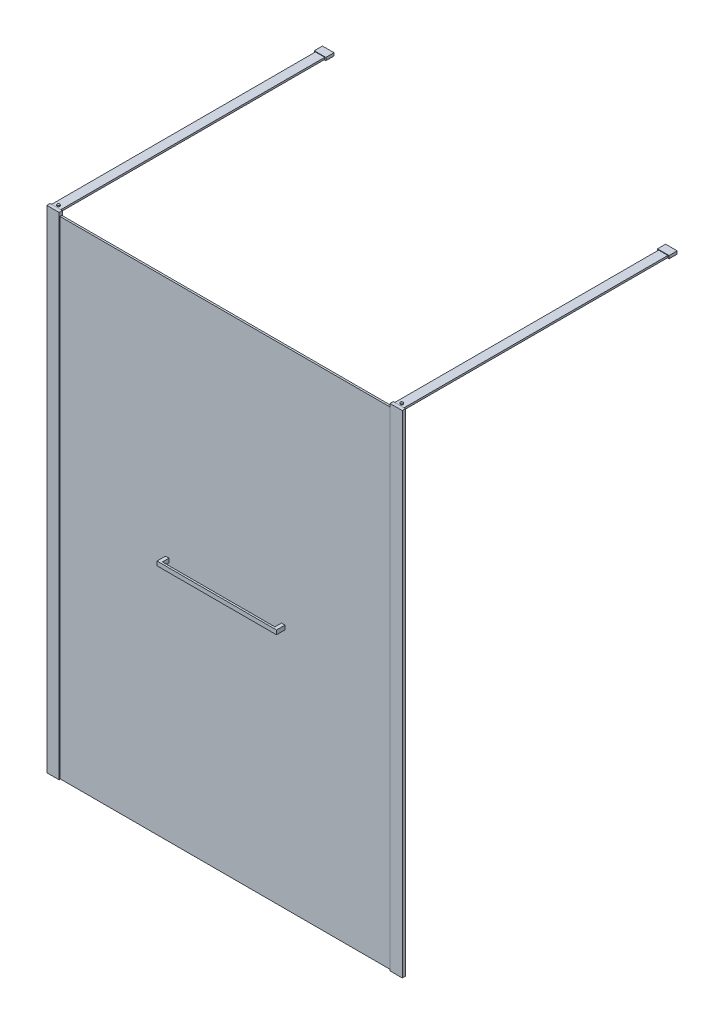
ISO-10303-21;
HEADER;
FILE_DESCRIPTION(('STEP AP214'),'2;1');
FILE_NAME('part.step','',(''),(''),'','','');
FILE_SCHEMA(('AUTOMOTIVE_DESIGN { 1 0 10303 214 1 1 1 1 }'));
ENDSEC;
DATA;
#1=APPLICATION_CONTEXT('core data for automotive mechanical design processes');
#2=APPLICATION_PROTOCOL_DEFINITION('international standard','automotive_design',2000,#1);
#3=PRODUCT_CONTEXT('',#1,'mechanical');
#4=PRODUCT('Part','Part','',(#3));
#5=PRODUCT_RELATED_PRODUCT_CATEGORY('part','',(#4));
#6=PRODUCT_DEFINITION_FORMATION('','',#4);
#7=PRODUCT_DEFINITION_CONTEXT('part definition',#1,'design');
#8=PRODUCT_DEFINITION('design','',#6,#7);
#9=PRODUCT_DEFINITION_SHAPE('','',#8);
#10=(LENGTH_UNIT() NAMED_UNIT(*) SI_UNIT(.MILLI.,.METRE.));
#11=(NAMED_UNIT(*) PLANE_ANGLE_UNIT() SI_UNIT($,.RADIAN.));
#12=(NAMED_UNIT(*) SI_UNIT($,.STERADIAN.) SOLID_ANGLE_UNIT());
#13=UNCERTAINTY_MEASURE_WITH_UNIT(LENGTH_MEASURE(1.E-05),#10,'distance_accuracy_value','');
#14=(GEOMETRIC_REPRESENTATION_CONTEXT(3) GLOBAL_UNCERTAINTY_ASSIGNED_CONTEXT((#13)) GLOBAL_UNIT_ASSIGNED_CONTEXT((#10,
#11,#12)) REPRESENTATION_CONTEXT('',''));
#15=CARTESIAN_POINT('',(0.,0.,0.));
#16=DIRECTION('',(0.,0.,1.));
#17=DIRECTION('',(1.,0.,0.));
#18=AXIS2_PLACEMENT_3D('',#15,#16,#17);
#19=CARTESIAN_POINT('',(523.9,1062.,-21.));
#20=DIRECTION('',(1.,0.,0.));
#21=DIRECTION('',(0.,0.,-1.));
#22=AXIS2_PLACEMENT_3D('',#19,#20,#21);
#23=PLANE('',#22);
#24=DIRECTION('',(0.,1.,0.));
#25=VECTOR('',#24,1.);
#26=CARTESIAN_POINT('',(523.9,1062.,25.5));
#27=LINE('',#26,#25);
#28=CARTESIAN_POINT('',(523.9,1044.,25.5));
#29=VERTEX_POINT('',#28);
#30=CARTESIAN_POINT('',(523.9,1062.,25.5));
#31=VERTEX_POINT('',#30);
#32=EDGE_CURVE('E63',#29,#31,#27,.T.);
#33=ORIENTED_EDGE('',*,*,#32,.F.);
#34=DIRECTION('',(0.,0.,1.));
#35=VECTOR('',#34,1.);
#36=CARTESIAN_POINT('',(523.9,1044.,-21.));
#37=LINE('',#36,#35);
#38=CARTESIAN_POINT('',(523.9,1044.,-21.));
#39=VERTEX_POINT('',#38);
#40=EDGE_CURVE('E12',#39,#29,#37,.T.);
#41=ORIENTED_EDGE('',*,*,#40,.F.);
#42=DIRECTION('',(0.,1.,0.));
#43=VECTOR('',#42,1.);
#44=CARTESIAN_POINT('',(523.9,1062.,-21.));
#45=LINE('',#44,#43);
#46=CARTESIAN_POINT('',(523.9,1062.,-21.));
#47=VERTEX_POINT('',#46);
#48=EDGE_CURVE('E193',#39,#47,#45,.T.);
#49=ORIENTED_EDGE('',*,*,#48,.T.);
#50=DIRECTION('',(0.,0.,1.));
#51=VECTOR('',#50,1.);
#52=CARTESIAN_POINT('',(523.9,1062.,-21.));
#53=LINE('',#52,#51);
#54=EDGE_CURVE('E176',#47,#31,#53,.T.);
#55=ORIENTED_EDGE('',*,*,#54,.T.);
#56=EDGE_LOOP('',(#33,#41,#49,#55));
#57=FACE_BOUND('',#56,.T.);
#58=ADVANCED_FACE('F46',(#57),#23,.T.);
#59=CARTESIAN_POINT('',(508.9,1044.,-21.));
#60=DIRECTION('',(0.,-1.,0.));
#61=DIRECTION('',(0.,0.,-1.));
#62=AXIS2_PLACEMENT_3D('',#59,#60,#61);
#63=PLANE('',#62);
#64=ORIENTED_EDGE('',*,*,#40,.T.);
#65=DIRECTION('',(-1.,0.,0.));
#66=VECTOR('',#65,1.);
#67=CARTESIAN_POINT('',(1028.59771560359,1044.,25.5));
#68=LINE('',#67,#66);
#69=CARTESIAN_POINT('',(1008.9,1044.,25.5));
#70=VERTEX_POINT('',#69);
#71=EDGE_CURVE('E166',#70,#29,#68,.T.);
#72=ORIENTED_EDGE('',*,*,#71,.F.);
#73=DIRECTION('',(0.,0.,1.));
#74=VECTOR('',#73,1.);
#75=CARTESIAN_POINT('',(1008.9,1044.,-21.));
#76=LINE('',#75,#74);
#77=CARTESIAN_POINT('',(1008.9,1044.,-21.));
#78=VERTEX_POINT('',#77);
#79=EDGE_CURVE('E149',#78,#70,#76,.T.);
#80=ORIENTED_EDGE('',*,*,#79,.F.);
#81=DIRECTION('',(1.,0.,0.));
#82=VECTOR('',#81,1.);
#83=CARTESIAN_POINT('',(1008.9,1044.,-21.));
#84=LINE('',#83,#82);
#85=CARTESIAN_POINT('',(1023.9,1044.,-21.));
#86=VERTEX_POINT('',#85);
#87=EDGE_CURVE('E131',#78,#86,#84,.T.);
#88=ORIENTED_EDGE('',*,*,#87,.T.);
#89=DIRECTION('',(0.,0.,1.));
#90=VECTOR('',#89,1.);
#91=CARTESIAN_POINT('',(1023.9,1044.,-21.));
#92=LINE('',#91,#90);
#93=CARTESIAN_POINT('',(1023.9,1044.,33.5));
#94=VERTEX_POINT('',#93);
#95=EDGE_CURVE('E147',#86,#94,#92,.T.);
#96=ORIENTED_EDGE('',*,*,#95,.T.);
#97=DIRECTION('',(1.,0.,0.));
#98=VECTOR('',#97,1.);
#99=CARTESIAN_POINT('',(508.9,1044.,33.5));
#100=LINE('',#99,#98);
#101=CARTESIAN_POINT('',(508.9,1044.,33.5));
#102=VERTEX_POINT('',#101);
#103=EDGE_CURVE('E135',#102,#94,#100,.T.);
#104=ORIENTED_EDGE('',*,*,#103,.F.);
#105=DIRECTION('',(0.,0.,1.));
#106=VECTOR('',#105,1.);
#107=CARTESIAN_POINT('',(508.9,1044.,-21.));
#108=LINE('',#107,#106);
#109=CARTESIAN_POINT('',(508.9,1044.,-21.));
#110=VERTEX_POINT('',#109);
#111=EDGE_CURVE('E55',#110,#102,#108,.T.);
#112=ORIENTED_EDGE('',*,*,#111,.F.);
#113=DIRECTION('',(1.,0.,0.));
#114=VECTOR('',#113,1.);
#115=CARTESIAN_POINT('',(508.9,1044.,-21.));
#116=LINE('',#115,#114);
#117=EDGE_CURVE('E181',#110,#39,#116,.T.);
#118=ORIENTED_EDGE('',*,*,#117,.T.);
#119=EDGE_LOOP('',(#64,#72,#80,#88,#96,#104,#112,#118));
#120=FACE_BOUND('',#119,.T.);
#121=ADVANCED_FACE('F197',(#120),#63,.T.);
#122=CARTESIAN_POINT('',(508.9,1062.,-21.));
#123=DIRECTION('',(-1.,0.,0.));
#124=DIRECTION('',(0.,0.,1.));
#125=AXIS2_PLACEMENT_3D('',#122,#123,#124);
#126=PLANE('',#125);
#127=ORIENTED_EDGE('',*,*,#111,.T.);
#128=DIRECTION('',(0.,-1.,0.));
#129=VECTOR('',#128,1.);
#130=CARTESIAN_POINT('',(508.9,1062.,33.5));
#131=LINE('',#130,#129);
#132=CARTESIAN_POINT('',(508.9,1062.,33.5));
#133=VERTEX_POINT('',#132);
#134=EDGE_CURVE('E121',#133,#102,#131,.T.);
#135=ORIENTED_EDGE('',*,*,#134,.F.);
#136=DIRECTION('',(0.,0.,1.));
#137=VECTOR('',#136,1.);
#138=CARTESIAN_POINT('',(508.9,1062.,-21.));
#139=LINE('',#138,#137);
#140=CARTESIAN_POINT('',(508.9,1062.,-21.));
#141=VERTEX_POINT('',#140);
#142=EDGE_CURVE('E116',#141,#133,#139,.T.);
#143=ORIENTED_EDGE('',*,*,#142,.F.);
#144=DIRECTION('',(0.,-1.,0.));
#145=VECTOR('',#144,1.);
#146=CARTESIAN_POINT('',(508.9,1062.,-21.));
#147=LINE('',#146,#145);
#148=EDGE_CURVE('E186',#141,#110,#147,.T.);
#149=ORIENTED_EDGE('',*,*,#148,.T.);
#150=EDGE_LOOP('',(#127,#135,#143,#149));
#151=FACE_BOUND('',#150,.T.);
#152=ADVANCED_FACE('F218',(#151),#126,.T.);
#153=CARTESIAN_POINT('',(508.9,1062.,-21.));
#154=DIRECTION('',(0.,1.,0.));
#155=DIRECTION('',(0.,0.,1.));
#156=AXIS2_PLACEMENT_3D('',#153,#154,#155);
#157=PLANE('',#156);
#158=ORIENTED_EDGE('',*,*,#142,.T.);
#159=DIRECTION('',(-1.,0.,0.));
#160=VECTOR('',#159,1.);
#161=CARTESIAN_POINT('',(508.9,1062.,33.5));
#162=LINE('',#161,#160);
#163=CARTESIAN_POINT('',(1023.9,1062.,33.5));
#164=VERTEX_POINT('',#163);
#165=EDGE_CURVE('E109',#164,#133,#162,.T.);
#166=ORIENTED_EDGE('',*,*,#165,.F.);
#167=DIRECTION('',(0.,0.,1.));
#168=VECTOR('',#167,1.);
#169=CARTESIAN_POINT('',(1023.9,1062.,-21.));
#170=LINE('',#169,#168);
#171=CARTESIAN_POINT('',(1023.9,1062.,-21.));
#172=VERTEX_POINT('',#171);
#173=EDGE_CURVE('E113',#172,#164,#170,.T.);
#174=ORIENTED_EDGE('',*,*,#173,.F.);
#175=DIRECTION('',(-1.,0.,0.));
#176=VECTOR('',#175,1.);
#177=CARTESIAN_POINT('',(1008.9,1062.,-21.));
#178=LINE('',#177,#176);
#179=CARTESIAN_POINT('',(1008.9,1062.,-21.));
#180=VERTEX_POINT('',#179);
#181=EDGE_CURVE('E138',#172,#180,#178,.T.);
#182=ORIENTED_EDGE('',*,*,#181,.T.);
#183=DIRECTION('',(0.,0.,1.));
#184=VECTOR('',#183,1.);
#185=CARTESIAN_POINT('',(1008.9,1062.,-21.));
#186=LINE('',#185,#184);
#187=CARTESIAN_POINT('',(1008.9,1062.,25.5));
#188=VERTEX_POINT('',#187);
#189=EDGE_CURVE('E130',#180,#188,#186,.T.);
#190=ORIENTED_EDGE('',*,*,#189,.T.);
#191=DIRECTION('',(-1.,0.,0.));
#192=VECTOR('',#191,1.);
#193=CARTESIAN_POINT('',(1028.59771560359,1062.,25.5));
#194=LINE('',#193,#192);
#195=EDGE_CURVE('E163',#188,#31,#194,.T.);
#196=ORIENTED_EDGE('',*,*,#195,.T.);
#197=ORIENTED_EDGE('',*,*,#54,.F.);
#198=DIRECTION('',(-1.,0.,0.));
#199=VECTOR('',#198,1.);
#200=CARTESIAN_POINT('',(508.9,1062.,-21.));
#201=LINE('',#200,#199);
#202=EDGE_CURVE('E190',#47,#141,#201,.T.);
#203=ORIENTED_EDGE('',*,*,#202,.T.);
#204=EDGE_LOOP('',(#158,#166,#174,#182,#190,#196,#197,#203));
#205=FACE_BOUND('',#204,.T.);
#206=ADVANCED_FACE('F111',(#205),#157,.T.);
#207=CARTESIAN_POINT('',(523.9,1044.,-21.));
#208=DIRECTION('',(0.,0.,1.));
#209=DIRECTION('',(1.,0.,0.));
#210=AXIS2_PLACEMENT_3D('',#207,#208,#209);
#211=PLANE('',#210);
#212=ORIENTED_EDGE('',*,*,#48,.F.);
#213=ORIENTED_EDGE('',*,*,#117,.F.);
#214=ORIENTED_EDGE('',*,*,#148,.F.);
#215=ORIENTED_EDGE('',*,*,#202,.F.);
#216=EDGE_LOOP('',(#212,#213,#214,#215));
#217=FACE_BOUND('',#216,.T.);
#218=ADVANCED_FACE('F225',(#217),#211,.F.);
#219=CARTESIAN_POINT('',(523.9,1044.,33.5));
#220=DIRECTION('',(0.,0.,1.));
#221=DIRECTION('',(1.,0.,0.));
#222=AXIS2_PLACEMENT_3D('',#219,#220,#221);
#223=PLANE('',#222);
#224=ORIENTED_EDGE('',*,*,#103,.T.);
#225=DIRECTION('',(0.,1.,0.));
#226=VECTOR('',#225,1.);
#227=CARTESIAN_POINT('',(1023.9,1062.,33.5));
#228=LINE('',#227,#226);
#229=EDGE_CURVE('E127',#94,#164,#228,.T.);
#230=ORIENTED_EDGE('',*,*,#229,.T.);
#231=ORIENTED_EDGE('',*,*,#165,.T.);
#232=ORIENTED_EDGE('',*,*,#134,.T.);
#233=EDGE_LOOP('',(#224,#230,#231,#232));
#234=FACE_BOUND('',#233,.T.);
#235=ADVANCED_FACE('F133',(#234),#223,.T.);
#236=CARTESIAN_POINT('',(1028.59771560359,1062.,25.5));
#237=DIRECTION('',(0.,0.,1.));
#238=DIRECTION('',(1.,0.,0.));
#239=AXIS2_PLACEMENT_3D('',#236,#237,#238);
#240=PLANE('',#239);
#241=ORIENTED_EDGE('',*,*,#195,.F.);
#242=DIRECTION('',(0.,-1.,0.));
#243=VECTOR('',#242,1.);
#244=CARTESIAN_POINT('',(1008.9,1062.,25.5));
#245=LINE('',#244,#243);
#246=EDGE_CURVE('E49',#188,#70,#245,.T.);
#247=ORIENTED_EDGE('',*,*,#246,.T.);
#248=ORIENTED_EDGE('',*,*,#71,.T.);
#249=ORIENTED_EDGE('',*,*,#32,.T.);
#250=EDGE_LOOP('',(#241,#247,#248,#249));
#251=FACE_BOUND('',#250,.T.);
#252=ADVANCED_FACE('F203',(#251),#240,.F.);
#253=CARTESIAN_POINT('',(1008.9,1062.,-21.));
#254=DIRECTION('',(-1.,0.,0.));
#255=DIRECTION('',(0.,0.,1.));
#256=AXIS2_PLACEMENT_3D('',#253,#254,#255);
#257=PLANE('',#256);
#258=ORIENTED_EDGE('',*,*,#246,.F.);
#259=ORIENTED_EDGE('',*,*,#189,.F.);
#260=DIRECTION('',(0.,-1.,0.));
#261=VECTOR('',#260,1.);
#262=CARTESIAN_POINT('',(1008.9,1062.,-21.));
#263=LINE('',#262,#261);
#264=EDGE_CURVE('E142',#180,#78,#263,.T.);
#265=ORIENTED_EDGE('',*,*,#264,.T.);
#266=ORIENTED_EDGE('',*,*,#79,.T.);
#267=EDGE_LOOP('',(#258,#259,#265,#266));
#268=FACE_BOUND('',#267,.T.);
#269=ADVANCED_FACE('F204',(#268),#257,.T.);
#270=CARTESIAN_POINT('',(1023.9,1062.,-21.));
#271=DIRECTION('',(1.,0.,0.));
#272=DIRECTION('',(0.,0.,-1.));
#273=AXIS2_PLACEMENT_3D('',#270,#271,#272);
#274=PLANE('',#273);
#275=ORIENTED_EDGE('',*,*,#173,.T.);
#276=ORIENTED_EDGE('',*,*,#229,.F.);
#277=ORIENTED_EDGE('',*,*,#95,.F.);
#278=DIRECTION('',(0.,1.,0.));
#279=VECTOR('',#278,1.);
#280=CARTESIAN_POINT('',(1023.9,1062.,-21.));
#281=LINE('',#280,#279);
#282=EDGE_CURVE('E129',#86,#172,#281,.T.);
#283=ORIENTED_EDGE('',*,*,#282,.T.);
#284=EDGE_LOOP('',(#275,#276,#277,#283));
#285=FACE_BOUND('',#284,.T.);
#286=ADVANCED_FACE('F126',(#285),#274,.T.);
#287=CARTESIAN_POINT('',(1023.9,1044.,-21.));
#288=DIRECTION('',(0.,0.,1.));
#289=DIRECTION('',(1.,0.,0.));
#290=AXIS2_PLACEMENT_3D('',#287,#288,#289);
#291=PLANE('',#290);
#292=ORIENTED_EDGE('',*,*,#282,.F.);
#293=ORIENTED_EDGE('',*,*,#87,.F.);
#294=ORIENTED_EDGE('',*,*,#264,.F.);
#295=ORIENTED_EDGE('',*,*,#181,.F.);
#296=EDGE_LOOP('',(#292,#293,#294,#295));
#297=FACE_BOUND('',#296,.T.);
#298=ADVANCED_FACE('F200',(#297),#291,.F.);
#299=CLOSED_SHELL('',(#58,#121,#152,#206,#218,#235,#252,#269,#286,#298));
#300=MANIFOLD_SOLID_BREP('B2',#299);
#301=CARTESIAN_POINT('',(46.5000000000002,2119.,-1184.));
#302=DIRECTION('',(-1.,0.,0.));
#303=DIRECTION('',(0.,0.,1.));
#304=AXIS2_PLACEMENT_3D('',#301,#302,#303);
#305=PLANE('',#304);
#306=DIRECTION('',(0.,-1.,0.));
#307=VECTOR('',#306,1.);
#308=CARTESIAN_POINT('',(46.5000000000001,2119.,-1152.));
#309=LINE('',#308,#307);
#310=CARTESIAN_POINT('',(46.5000000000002,2119.,-1152.));
#311=VERTEX_POINT('',#310);
#312=CARTESIAN_POINT('',(46.5000000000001,2111.,-1152.));
#313=VERTEX_POINT('',#312);
#314=EDGE_CURVE('E417',#311,#313,#309,.T.);
#315=ORIENTED_EDGE('',*,*,#314,.F.);
#316=DIRECTION('',(0.,0.,1.));
#317=VECTOR('',#316,1.);
#318=CARTESIAN_POINT('',(46.5000000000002,2119.,-1184.));
#319=LINE('',#318,#317);
#320=CARTESIAN_POINT('',(46.5,2119.,-14.));
#321=VERTEX_POINT('',#320);
#322=EDGE_CURVE('E432',#311,#321,#319,.T.);
#323=ORIENTED_EDGE('',*,*,#322,.T.);
#324=DIRECTION('',(0.,-1.,0.));
#325=VECTOR('',#324,1.);
#326=CARTESIAN_POINT('',(46.5,2119.,-14.));
#327=LINE('',#326,#325);
#328=CARTESIAN_POINT('',(46.5,2111.,-14.));
#329=VERTEX_POINT('',#328);
#330=EDGE_CURVE('E420',#321,#329,#327,.T.);
#331=ORIENTED_EDGE('',*,*,#330,.T.);
#332=DIRECTION('',(0.,0.,1.));
#333=VECTOR('',#332,1.);
#334=CARTESIAN_POINT('',(46.5000000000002,2111.,-1184.));
#335=LINE('',#334,#333);
#336=EDGE_CURVE('E327',#313,#329,#335,.T.);
#337=ORIENTED_EDGE('',*,*,#336,.F.);
#338=EDGE_LOOP('',(#315,#323,#331,#337));
#339=FACE_BOUND('',#338,.T.);
#340=ADVANCED_FACE('F319',(#339),#305,.F.);
#341=CARTESIAN_POINT('',(46.5000000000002,2111.,-1184.));
#342=DIRECTION('',(0.,1.,0.));
#343=DIRECTION('',(0.,0.,1.));
#344=AXIS2_PLACEMENT_3D('',#341,#342,#343);
#345=PLANE('',#344);
#346=DIRECTION('',(-1.,0.,0.));
#347=VECTOR('',#346,1.);
#348=CARTESIAN_POINT('',(46.5000000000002,2111.,-1152.));
#349=LINE('',#348,#347);
#350=CARTESIAN_POINT('',(6.50000000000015,2111.,-1152.));
#351=VERTEX_POINT('',#350);
#352=EDGE_CURVE('E334',#313,#351,#349,.T.);
#353=ORIENTED_EDGE('',*,*,#352,.F.);
#354=ORIENTED_EDGE('',*,*,#336,.T.);
#355=DIRECTION('',(-1.,0.,0.));
#356=VECTOR('',#355,1.);
#357=CARTESIAN_POINT('',(46.5,2111.,-14.));
#358=LINE('',#357,#356);
#359=CARTESIAN_POINT('',(6.5,2111.,-14.));
#360=VERTEX_POINT('',#359);
#361=EDGE_CURVE('E423',#329,#360,#358,.T.);
#362=ORIENTED_EDGE('',*,*,#361,.T.);
#363=DIRECTION('',(0.,0.,1.));
#364=VECTOR('',#363,1.);
#365=CARTESIAN_POINT('',(6.50000000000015,2111.,-1184.));
#366=LINE('',#365,#364);
#367=EDGE_CURVE('E436',#351,#360,#366,.T.);
#368=ORIENTED_EDGE('',*,*,#367,.F.);
#369=EDGE_LOOP('',(#353,#354,#362,#368));
#370=FACE_BOUND('',#369,.T.);
#371=ADVANCED_FACE('F438',(#370),#345,.F.);
#372=CARTESIAN_POINT('',(6.50000000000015,2119.,-1184.));
#373=DIRECTION('',(1.,0.,0.));
#374=DIRECTION('',(0.,0.,-1.));
#375=AXIS2_PLACEMENT_3D('',#372,#373,#374);
#376=PLANE('',#375);
#377=DIRECTION('',(0.,1.,0.));
#378=VECTOR('',#377,1.);
#379=CARTESIAN_POINT('',(6.50000000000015,2119.,-1152.));
#380=LINE('',#379,#378);
#381=CARTESIAN_POINT('',(6.50000000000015,2119.,-1152.));
#382=VERTEX_POINT('',#381);
#383=EDGE_CURVE('E342',#351,#382,#380,.T.);
#384=ORIENTED_EDGE('',*,*,#383,.F.);
#385=ORIENTED_EDGE('',*,*,#367,.T.);
#386=DIRECTION('',(0.,1.,0.));
#387=VECTOR('',#386,1.);
#388=CARTESIAN_POINT('',(6.5,2119.,-14.));
#389=LINE('',#388,#387);
#390=CARTESIAN_POINT('',(6.5,2119.,-14.));
#391=VERTEX_POINT('',#390);
#392=EDGE_CURVE('E426',#360,#391,#389,.T.);
#393=ORIENTED_EDGE('',*,*,#392,.T.);
#394=DIRECTION('',(0.,0.,1.));
#395=VECTOR('',#394,1.);
#396=CARTESIAN_POINT('',(6.50000000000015,2119.,-1184.));
#397=LINE('',#396,#395);
#398=EDGE_CURVE('E434',#382,#391,#397,.T.);
#399=ORIENTED_EDGE('',*,*,#398,.F.);
#400=EDGE_LOOP('',(#384,#385,#393,#399));
#401=FACE_BOUND('',#400,.T.);
#402=ADVANCED_FACE('F448',(#401),#376,.F.);
#403=CARTESIAN_POINT('',(46.5000000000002,2119.,-1184.));
#404=DIRECTION('',(0.,-1.,0.));
#405=DIRECTION('',(0.,0.,-1.));
#406=AXIS2_PLACEMENT_3D('',#403,#404,#405);
#407=PLANE('',#406);
#408=CARTESIAN_POINT('',(26.5,2119.,-24.));
#409=DIRECTION('',(0.,-1.,0.));
#410=DIRECTION('',(0.,0.,-1.));
#411=AXIS2_PLACEMENT_3D('',#408,#409,#410);
#412=CIRCLE('',#411,5.89999999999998);
#413=CARTESIAN_POINT('',(26.5,2119.,-29.9));
#414=VERTEX_POINT('',#413);
#415=EDGE_CURVE('E511',#414,#414,#412,.T.);
#416=ORIENTED_EDGE('',*,*,#415,.T.);
#417=EDGE_LOOP('',(#416));
#418=FACE_BOUND('',#417,.T.);
#419=DIRECTION('',(1.,0.,0.));
#420=VECTOR('',#419,1.);
#421=CARTESIAN_POINT('',(46.5000000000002,2119.,-1152.));
#422=LINE('',#421,#420);
#423=EDGE_CURVE('E44',#382,#311,#422,.T.);
#424=ORIENTED_EDGE('',*,*,#423,.F.);
#425=ORIENTED_EDGE('',*,*,#398,.T.);
#426=DIRECTION('',(1.,0.,0.));
#427=VECTOR('',#426,1.);
#428=CARTESIAN_POINT('',(46.5,2119.,-14.));
#429=LINE('',#428,#427);
#430=EDGE_CURVE('E429',#391,#321,#429,.T.);
#431=ORIENTED_EDGE('',*,*,#430,.T.);
#432=ORIENTED_EDGE('',*,*,#322,.F.);
#433=EDGE_LOOP('',(#424,#425,#431,#432));
#434=FACE_BOUND('',#433,.T.);
#435=ADVANCED_FACE('F447',(#418,#434),#407,.F.);
#436=CARTESIAN_POINT('',(46.5,2111.,-14.));
#437=DIRECTION('',(0.,0.,-1.));
#438=DIRECTION('',(-1.,0.,0.));
#439=AXIS2_PLACEMENT_3D('',#436,#437,#438);
#440=PLANE('',#439);
#441=ORIENTED_EDGE('',*,*,#330,.F.);
#442=ORIENTED_EDGE('',*,*,#430,.F.);
#443=ORIENTED_EDGE('',*,*,#392,.F.);
#444=ORIENTED_EDGE('',*,*,#361,.F.);
#445=EDGE_LOOP('',(#441,#442,#443,#444));
#446=FACE_BOUND('',#445,.T.);
#447=ADVANCED_FACE('F444',(#446),#440,.F.);
#448=CARTESIAN_POINT('',(1.50000000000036,2108.75,-1152.));
#449=DIRECTION('',(0.,0.,-1.));
#450=DIRECTION('',(-1.,0.,0.));
#451=AXIS2_PLACEMENT_3D('',#448,#449,#450);
#452=PLANE('',#451);
#453=DIRECTION('',(0.,1.,0.));
#454=VECTOR('',#453,1.);
#455=CARTESIAN_POINT('',(1.50000000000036,2121.25,-1152.));
#456=LINE('',#455,#454);
#457=CARTESIAN_POINT('',(1.50000000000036,2108.75,-1152.));
#458=VERTEX_POINT('',#457);
#459=CARTESIAN_POINT('',(1.50000000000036,2121.25,-1152.));
#460=VERTEX_POINT('',#459);
#461=EDGE_CURVE('E409',#458,#460,#456,.T.);
#462=ORIENTED_EDGE('',*,*,#461,.F.);
#463=DIRECTION('',(-1.,0.,0.));
#464=VECTOR('',#463,1.);
#465=CARTESIAN_POINT('',(51.5000000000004,2108.75,-1152.));
#466=LINE('',#465,#464);
#467=CARTESIAN_POINT('',(51.5000000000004,2108.75,-1152.));
#468=VERTEX_POINT('',#467);
#469=EDGE_CURVE('E405',#468,#458,#466,.T.);
#470=ORIENTED_EDGE('',*,*,#469,.F.);
#471=DIRECTION('',(0.,-1.,0.));
#472=VECTOR('',#471,1.);
#473=CARTESIAN_POINT('',(51.5000000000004,2121.25,-1152.));
#474=LINE('',#473,#472);
#475=CARTESIAN_POINT('',(51.5000000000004,2121.25,-1152.));
#476=VERTEX_POINT('',#475);
#477=EDGE_CURVE('E492',#476,#468,#474,.T.);
#478=ORIENTED_EDGE('',*,*,#477,.F.);
#479=DIRECTION('',(1.,0.,0.));
#480=VECTOR('',#479,1.);
#481=CARTESIAN_POINT('',(51.5000000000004,2121.25,-1152.));
#482=LINE('',#481,#480);
#483=EDGE_CURVE('E495',#460,#476,#482,.T.);
#484=ORIENTED_EDGE('',*,*,#483,.F.);
#485=EDGE_LOOP('',(#462,#470,#478,#484));
#486=FACE_BOUND('',#485,.T.);
#487=ORIENTED_EDGE('',*,*,#423,.T.);
#488=ORIENTED_EDGE('',*,*,#314,.T.);
#489=ORIENTED_EDGE('',*,*,#352,.T.);
#490=ORIENTED_EDGE('',*,*,#383,.T.);
#491=EDGE_LOOP('',(#487,#488,#489,#490));
#492=FACE_BOUND('',#491,.T.);
#493=ADVANCED_FACE('F450',(#486,#492),#452,.F.);
#494=CARTESIAN_POINT('',(1.50000000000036,2121.25,-1187.));
#495=DIRECTION('',(1.,0.,0.));
#496=DIRECTION('',(0.,0.,-1.));
#497=AXIS2_PLACEMENT_3D('',#494,#495,#496);
#498=PLANE('',#497);
#499=ORIENTED_EDGE('',*,*,#461,.T.);
#500=DIRECTION('',(0.,0.,1.));
#501=VECTOR('',#500,1.);
#502=CARTESIAN_POINT('',(1.50000000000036,2121.25,-1187.));
#503=LINE('',#502,#501);
#504=CARTESIAN_POINT('',(1.50000000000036,2121.25,-1187.));
#505=VERTEX_POINT('',#504);
#506=EDGE_CURVE('E389',#505,#460,#503,.T.);
#507=ORIENTED_EDGE('',*,*,#506,.F.);
#508=DIRECTION('',(0.,1.,0.));
#509=VECTOR('',#508,1.);
#510=CARTESIAN_POINT('',(1.50000000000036,2121.25,-1187.));
#511=LINE('',#510,#509);
#512=CARTESIAN_POINT('',(1.50000000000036,2108.75,-1187.));
#513=VERTEX_POINT('',#512);
#514=EDGE_CURVE('E396',#513,#505,#511,.T.);
#515=ORIENTED_EDGE('',*,*,#514,.F.);
#516=DIRECTION('',(0.,0.,1.));
#517=VECTOR('',#516,1.);
#518=CARTESIAN_POINT('',(1.50000000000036,2108.75,-1187.));
#519=LINE('',#518,#517);
#520=EDGE_CURVE('E489',#513,#458,#519,.T.);
#521=ORIENTED_EDGE('',*,*,#520,.T.);
#522=EDGE_LOOP('',(#499,#507,#515,#521));
#523=FACE_BOUND('',#522,.T.);
#524=ADVANCED_FACE('F407',(#523),#498,.F.);
#525=CARTESIAN_POINT('',(51.5000000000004,2121.25,-1187.));
#526=DIRECTION('',(0.,-1.,0.));
#527=DIRECTION('',(0.,0.,-1.));
#528=AXIS2_PLACEMENT_3D('',#525,#526,#527);
#529=PLANE('',#528);
#530=ORIENTED_EDGE('',*,*,#483,.T.);
#531=DIRECTION('',(0.,0.,1.));
#532=VECTOR('',#531,1.);
#533=CARTESIAN_POINT('',(51.5000000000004,2121.25,-1187.));
#534=LINE('',#533,#532);
#535=CARTESIAN_POINT('',(51.5000000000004,2121.25,-1187.));
#536=VERTEX_POINT('',#535);
#537=EDGE_CURVE('E392',#536,#476,#534,.T.);
#538=ORIENTED_EDGE('',*,*,#537,.F.);
#539=DIRECTION('',(1.,0.,0.));
#540=VECTOR('',#539,1.);
#541=CARTESIAN_POINT('',(51.5000000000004,2121.25,-1187.));
#542=LINE('',#541,#540);
#543=EDGE_CURVE('E385',#505,#536,#542,.T.);
#544=ORIENTED_EDGE('',*,*,#543,.F.);
#545=ORIENTED_EDGE('',*,*,#506,.T.);
#546=EDGE_LOOP('',(#530,#538,#544,#545));
#547=FACE_BOUND('',#546,.T.);
#548=ADVANCED_FACE('F387',(#547),#529,.F.);
#549=CARTESIAN_POINT('',(51.5000000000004,2121.25,-1187.));
#550=DIRECTION('',(-1.,0.,0.));
#551=DIRECTION('',(0.,0.,1.));
#552=AXIS2_PLACEMENT_3D('',#549,#550,#551);
#553=PLANE('',#552);
#554=ORIENTED_EDGE('',*,*,#477,.T.);
#555=DIRECTION('',(0.,0.,1.));
#556=VECTOR('',#555,1.);
#557=CARTESIAN_POINT('',(51.5000000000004,2108.75,-1187.));
#558=LINE('',#557,#556);
#559=CARTESIAN_POINT('',(51.5000000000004,2108.75,-1187.));
#560=VERTEX_POINT('',#559);
#561=EDGE_CURVE('E412',#560,#468,#558,.T.);
#562=ORIENTED_EDGE('',*,*,#561,.F.);
#563=DIRECTION('',(0.,-1.,0.));
#564=VECTOR('',#563,1.);
#565=CARTESIAN_POINT('',(51.5000000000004,2121.25,-1187.));
#566=LINE('',#565,#564);
#567=EDGE_CURVE('E395',#536,#560,#566,.T.);
#568=ORIENTED_EDGE('',*,*,#567,.F.);
#569=ORIENTED_EDGE('',*,*,#537,.T.);
#570=EDGE_LOOP('',(#554,#562,#568,#569));
#571=FACE_BOUND('',#570,.T.);
#572=ADVANCED_FACE('F477',(#571),#553,.F.);
#573=CARTESIAN_POINT('',(51.5000000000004,2108.75,-1187.));
#574=DIRECTION('',(0.,1.,0.));
#575=DIRECTION('',(0.,0.,1.));
#576=AXIS2_PLACEMENT_3D('',#573,#574,#575);
#577=PLANE('',#576);
#578=ORIENTED_EDGE('',*,*,#469,.T.);
#579=ORIENTED_EDGE('',*,*,#520,.F.);
#580=DIRECTION('',(-1.,0.,0.));
#581=VECTOR('',#580,1.);
#582=CARTESIAN_POINT('',(51.5000000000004,2108.75,-1187.));
#583=LINE('',#582,#581);
#584=EDGE_CURVE('E401',#560,#513,#583,.T.);
#585=ORIENTED_EDGE('',*,*,#584,.F.);
#586=ORIENTED_EDGE('',*,*,#561,.T.);
#587=EDGE_LOOP('',(#578,#579,#585,#586));
#588=FACE_BOUND('',#587,.T.);
#589=ADVANCED_FACE('F479',(#588),#577,.F.);
#590=CARTESIAN_POINT('',(1.50000000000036,2108.75,-1187.));
#591=DIRECTION('',(0.,0.,-1.));
#592=DIRECTION('',(-1.,0.,0.));
#593=AXIS2_PLACEMENT_3D('',#590,#591,#592);
#594=PLANE('',#593);
#595=ORIENTED_EDGE('',*,*,#514,.T.);
#596=ORIENTED_EDGE('',*,*,#543,.T.);
#597=ORIENTED_EDGE('',*,*,#567,.T.);
#598=ORIENTED_EDGE('',*,*,#584,.T.);
#599=EDGE_LOOP('',(#595,#596,#597,#598));
#600=FACE_BOUND('',#599,.T.);
#601=ADVANCED_FACE('F399',(#600),#594,.T.);
#602=CARTESIAN_POINT('',(26.5,2115.34934210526,-24.));
#603=DIRECTION('',(0.,-1.,0.));
#604=DIRECTION('',(0.,0.,-1.));
#605=AXIS2_PLACEMENT_3D('',#602,#603,#604);
#606=SPHERICAL_SURFACE('',#605,9.35065789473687);
#607=CARTESIAN_POINT('',(26.5,2122.8,-24.));
#608=DIRECTION('',(0.,-1.,0.));
#609=DIRECTION('',(0.,0.,-1.));
#610=AXIS2_PLACEMENT_3D('',#607,#608,#609);
#611=CIRCLE('',#610,5.64999999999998);
#612=CARTESIAN_POINT('',(26.5,2122.8,-29.65));
#613=VERTEX_POINT('',#612);
#614=EDGE_CURVE('E508',#613,#613,#611,.T.);
#615=ORIENTED_EDGE('',*,*,#614,.F.);
#616=EDGE_LOOP('',(#615));
#617=FACE_BOUND('',#616,.T.);
#618=ADVANCED_FACE('F486',(#617),#606,.T.);
#619=CARTESIAN_POINT('',(26.5,2119.,-24.));
#620=DIRECTION('',(0.,-1.,0.));
#621=DIRECTION('',(0.,0.,-1.));
#622=AXIS2_PLACEMENT_3D('',#619,#620,#621);
#623=CONICAL_SURFACE('',#622,5.89999999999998,0.0656948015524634);
#624=ORIENTED_EDGE('',*,*,#614,.T.);
#625=EDGE_LOOP('',(#624));
#626=FACE_BOUND('',#625,.T.);
#627=ORIENTED_EDGE('',*,*,#415,.F.);
#628=EDGE_LOOP('',(#627));
#629=FACE_BOUND('',#628,.T.);
#630=ADVANCED_FACE('F515',(#626,#629),#623,.T.);
#631=CLOSED_SHELL('',(#340,#371,#402,#435,#447,#493,#524,#548,#572,#589,#601,#618,#630));
#632=CARTESIAN_POINT('',(26.5,2122.53567623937,-24.));
#633=DIRECTION('',(0.,-1.,0.));
#634=DIRECTION('',(0.,0.,-1.));
#635=AXIS2_PLACEMENT_3D('',#632,#633,#634);
#636=CONICAL_SURFACE('',#635,5.16630882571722,0.065694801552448);
#637=CARTESIAN_POINT('',(26.5,2119.,-24.));
#638=DIRECTION('',(0.,-1.,0.));
#639=DIRECTION('',(0.,0.,-1.));
#640=AXIS2_PLACEMENT_3D('',#637,#638,#639);
#641=CIRCLE('',#640,5.39891910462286);
#642=CARTESIAN_POINT('',(26.5,2119.,-29.3989191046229));
#643=VERTEX_POINT('',#642);
#644=EDGE_CURVE('E496',#643,#643,#641,.T.);
#645=ORIENTED_EDGE('',*,*,#644,.T.);
#646=EDGE_LOOP('',(#645));
#647=FACE_BOUND('',#646,.T.);
#648=CARTESIAN_POINT('',(26.5,2122.53567623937,-24.));
#649=DIRECTION('',(0.,-1.,0.));
#650=DIRECTION('',(0.,0.,-1.));
#651=AXIS2_PLACEMENT_3D('',#648,#649,#650);
#652=CIRCLE('',#651,5.16630882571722);
#653=CARTESIAN_POINT('',(26.5,2122.53567623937,-29.1663088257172));
#654=VERTEX_POINT('',#653);
#655=EDGE_CURVE('E500',#654,#654,#652,.T.);
#656=ORIENTED_EDGE('',*,*,#655,.F.);
#657=EDGE_LOOP('',(#656));
#658=FACE_BOUND('',#657,.T.);
#659=ADVANCED_FACE('F529',(#647,#658),#636,.F.);
#660=CARTESIAN_POINT('',(26.5,2115.34934210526,-24.));
#661=DIRECTION('',(0.,-1.,0.));
#662=DIRECTION('',(0.,0.,-1.));
#663=AXIS2_PLACEMENT_3D('',#660,#661,#662);
#664=SPHERICAL_SURFACE('',#663,8.85065789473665);
#665=ORIENTED_EDGE('',*,*,#655,.T.);
#666=EDGE_LOOP('',(#665));
#667=FACE_BOUND('',#666,.T.);
#668=ADVANCED_FACE('F526',(#667),#664,.F.);
#669=ORIENTED_EDGE('',*,*,#644,.F.);
#670=EDGE_LOOP('',(#669));
#671=FACE_BOUND('',#670,.T.);
#672=ADVANCED_FACE('F473',(#671),#407,.F.);
#673=CLOSED_SHELL('',(#659,#668,#672));
#674=ORIENTED_CLOSED_SHELL('',*,#673,.T.);
#675=BREP_WITH_VOIDS('B6',#631,(#674));
#676=CARTESIAN_POINT('',(1526.3,2119.,-1184.));
#677=DIRECTION('',(0.,-1.,0.));
#678=DIRECTION('',(0.,0.,-1.));
#679=AXIS2_PLACEMENT_3D('',#676,#677,#678);
#680=PLANE('',#679);
#681=CARTESIAN_POINT('',(1506.3,2119.,-23.9999999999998));
#682=DIRECTION('',(0.,-1.,0.));
#683=DIRECTION('',(0.,0.,-1.));
#684=AXIS2_PLACEMENT_3D('',#681,#682,#683);
#685=CIRCLE('',#684,5.89999999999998);
#686=CARTESIAN_POINT('',(1506.3,2119.,-29.8999999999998));
#687=VERTEX_POINT('',#686);
#688=EDGE_CURVE('E814',#687,#687,#685,.T.);
#689=ORIENTED_EDGE('',*,*,#688,.T.);
#690=EDGE_LOOP('',(#689));
#691=FACE_BOUND('',#690,.T.);
#692=DIRECTION('',(1.,0.,0.));
#693=VECTOR('',#692,1.);
#694=CARTESIAN_POINT('',(1526.3,2119.,-1152.));
#695=LINE('',#694,#693);
#696=CARTESIAN_POINT('',(1486.3,2119.,-1152.));
#697=VERTEX_POINT('',#696);
#698=CARTESIAN_POINT('',(1526.3,2119.,-1152.));
#699=VERTEX_POINT('',#698);
#700=EDGE_CURVE('E316',#697,#699,#695,.T.);
#701=ORIENTED_EDGE('',*,*,#700,.F.);
#702=DIRECTION('',(0.,0.,1.));
#703=VECTOR('',#702,1.);
#704=CARTESIAN_POINT('',(1486.3,2119.,-1184.));
#705=LINE('',#704,#703);
#706=CARTESIAN_POINT('',(1486.3,2119.,-13.9999999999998));
#707=VERTEX_POINT('',#706);
#708=EDGE_CURVE('E755',#697,#707,#705,.T.);
#709=ORIENTED_EDGE('',*,*,#708,.T.);
#710=DIRECTION('',(1.,0.,0.));
#711=VECTOR('',#710,1.);
#712=CARTESIAN_POINT('',(1526.3,2119.,-13.9999999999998));
#713=LINE('',#712,#711);
#714=CARTESIAN_POINT('',(1526.3,2119.,-13.9999999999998));
#715=VERTEX_POINT('',#714);
#716=EDGE_CURVE('E750',#707,#715,#713,.T.);
#717=ORIENTED_EDGE('',*,*,#716,.T.);
#718=DIRECTION('',(0.,0.,1.));
#719=VECTOR('',#718,1.);
#720=CARTESIAN_POINT('',(1526.3,2119.,-1184.));
#721=LINE('',#720,#719);
#722=EDGE_CURVE('E753',#699,#715,#721,.T.);
#723=ORIENTED_EDGE('',*,*,#722,.F.);
#724=EDGE_LOOP('',(#701,#709,#717,#723));
#725=FACE_BOUND('',#724,.T.);
#726=ADVANCED_FACE('F639',(#691,#725),#680,.F.);
#727=CARTESIAN_POINT('',(1526.3,2119.,-1184.));
#728=DIRECTION('',(-1.,0.,0.));
#729=DIRECTION('',(0.,0.,1.));
#730=AXIS2_PLACEMENT_3D('',#727,#728,#729);
#731=PLANE('',#730);
#732=DIRECTION('',(0.,-1.,0.));
#733=VECTOR('',#732,1.);
#734=CARTESIAN_POINT('',(1526.3,2119.,-1152.));
#735=LINE('',#734,#733);
#736=CARTESIAN_POINT('',(1526.3,2111.,-1152.));
#737=VERTEX_POINT('',#736);
#738=EDGE_CURVE('E738',#699,#737,#735,.T.);
#739=ORIENTED_EDGE('',*,*,#738,.F.);
#740=ORIENTED_EDGE('',*,*,#722,.T.);
#741=DIRECTION('',(0.,-1.,0.));
#742=VECTOR('',#741,1.);
#743=CARTESIAN_POINT('',(1526.3,2119.,-13.9999999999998));
#744=LINE('',#743,#742);
#745=CARTESIAN_POINT('',(1526.3,2111.,-13.9999999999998));
#746=VERTEX_POINT('',#745);
#747=EDGE_CURVE('E741',#715,#746,#744,.T.);
#748=ORIENTED_EDGE('',*,*,#747,.T.);
#749=DIRECTION('',(0.,0.,1.));
#750=VECTOR('',#749,1.);
#751=CARTESIAN_POINT('',(1526.3,2111.,-1184.));
#752=LINE('',#751,#750);
#753=EDGE_CURVE('E648',#737,#746,#752,.T.);
#754=ORIENTED_EDGE('',*,*,#753,.F.);
#755=EDGE_LOOP('',(#739,#740,#748,#754));
#756=FACE_BOUND('',#755,.T.);
#757=ADVANCED_FACE('F641',(#756),#731,.F.);
#758=CARTESIAN_POINT('',(1526.3,2111.,-1184.));
#759=DIRECTION('',(0.,1.,0.));
#760=DIRECTION('',(0.,0.,1.));
#761=AXIS2_PLACEMENT_3D('',#758,#759,#760);
#762=PLANE('',#761);
#763=DIRECTION('',(-1.,0.,0.));
#764=VECTOR('',#763,1.);
#765=CARTESIAN_POINT('',(1526.3,2111.,-1152.));
#766=LINE('',#765,#764);
#767=CARTESIAN_POINT('',(1486.3,2111.,-1152.));
#768=VERTEX_POINT('',#767);
#769=EDGE_CURVE('E655',#737,#768,#766,.T.);
#770=ORIENTED_EDGE('',*,*,#769,.F.);
#771=ORIENTED_EDGE('',*,*,#753,.T.);
#772=DIRECTION('',(-1.,0.,0.));
#773=VECTOR('',#772,1.);
#774=CARTESIAN_POINT('',(1526.3,2111.,-13.9999999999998));
#775=LINE('',#774,#773);
#776=CARTESIAN_POINT('',(1486.3,2111.,-13.9999999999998));
#777=VERTEX_POINT('',#776);
#778=EDGE_CURVE('E744',#746,#777,#775,.T.);
#779=ORIENTED_EDGE('',*,*,#778,.T.);
#780=DIRECTION('',(0.,0.,1.));
#781=VECTOR('',#780,1.);
#782=CARTESIAN_POINT('',(1486.3,2111.,-1184.));
#783=LINE('',#782,#781);
#784=EDGE_CURVE('E757',#768,#777,#783,.T.);
#785=ORIENTED_EDGE('',*,*,#784,.F.);
#786=EDGE_LOOP('',(#770,#771,#779,#785));
#787=FACE_BOUND('',#786,.T.);
#788=ADVANCED_FACE('F759',(#787),#762,.F.);
#789=CARTESIAN_POINT('',(1486.3,2119.,-1184.));
#790=DIRECTION('',(1.,0.,0.));
#791=DIRECTION('',(0.,0.,-1.));
#792=AXIS2_PLACEMENT_3D('',#789,#790,#791);
#793=PLANE('',#792);
#794=DIRECTION('',(0.,1.,0.));
#795=VECTOR('',#794,1.);
#796=CARTESIAN_POINT('',(1486.3,2119.,-1152.));
#797=LINE('',#796,#795);
#798=EDGE_CURVE('E663',#768,#697,#797,.T.);
#799=ORIENTED_EDGE('',*,*,#798,.F.);
#800=ORIENTED_EDGE('',*,*,#784,.T.);
#801=DIRECTION('',(0.,1.,0.));
#802=VECTOR('',#801,1.);
#803=CARTESIAN_POINT('',(1486.3,2119.,-13.9999999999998));
#804=LINE('',#803,#802);
#805=EDGE_CURVE('E747',#777,#707,#804,.T.);
#806=ORIENTED_EDGE('',*,*,#805,.T.);
#807=ORIENTED_EDGE('',*,*,#708,.F.);
#808=EDGE_LOOP('',(#799,#800,#806,#807));
#809=FACE_BOUND('',#808,.T.);
#810=ADVANCED_FACE('F768',(#809),#793,.F.);
#811=CARTESIAN_POINT('',(1526.3,2111.,-13.9999999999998));
#812=DIRECTION('',(0.,0.,-1.));
#813=DIRECTION('',(-1.,0.,0.));
#814=AXIS2_PLACEMENT_3D('',#811,#812,#813);
#815=PLANE('',#814);
#816=ORIENTED_EDGE('',*,*,#747,.F.);
#817=ORIENTED_EDGE('',*,*,#716,.F.);
#818=ORIENTED_EDGE('',*,*,#805,.F.);
#819=ORIENTED_EDGE('',*,*,#778,.F.);
#820=EDGE_LOOP('',(#816,#817,#818,#819));
#821=FACE_BOUND('',#820,.T.);
#822=ADVANCED_FACE('F765',(#821),#815,.F.);
#823=CARTESIAN_POINT('',(1481.3,2108.75,-1152.));
#824=DIRECTION('',(0.,0.,-1.));
#825=DIRECTION('',(-1.,0.,0.));
#826=AXIS2_PLACEMENT_3D('',#823,#824,#825);
#827=PLANE('',#826);
#828=DIRECTION('',(0.,1.,0.));
#829=VECTOR('',#828,1.);
#830=CARTESIAN_POINT('',(1481.3,2121.25,-1152.));
#831=LINE('',#830,#829);
#832=CARTESIAN_POINT('',(1481.3,2108.75,-1152.));
#833=VERTEX_POINT('',#832);
#834=CARTESIAN_POINT('',(1481.3,2121.25,-1152.));
#835=VERTEX_POINT('',#834);
#836=EDGE_CURVE('E730',#833,#835,#831,.T.);
#837=ORIENTED_EDGE('',*,*,#836,.F.);
#838=DIRECTION('',(-1.,0.,0.));
#839=VECTOR('',#838,1.);
#840=CARTESIAN_POINT('',(1531.3,2108.75,-1152.));
#841=LINE('',#840,#839);
#842=CARTESIAN_POINT('',(1531.3,2108.75,-1152.));
#843=VERTEX_POINT('',#842);
#844=EDGE_CURVE('E726',#843,#833,#841,.T.);
#845=ORIENTED_EDGE('',*,*,#844,.F.);
#846=DIRECTION('',(0.,-1.,0.));
#847=VECTOR('',#846,1.);
#848=CARTESIAN_POINT('',(1531.3,2121.25,-1152.));
#849=LINE('',#848,#847);
#850=CARTESIAN_POINT('',(1531.3,2121.25,-1152.));
#851=VERTEX_POINT('',#850);
#852=EDGE_CURVE('E822',#851,#843,#849,.T.);
#853=ORIENTED_EDGE('',*,*,#852,.F.);
#854=DIRECTION('',(1.,0.,0.));
#855=VECTOR('',#854,1.);
#856=CARTESIAN_POINT('',(1531.3,2121.25,-1152.));
#857=LINE('',#856,#855);
#858=EDGE_CURVE('E820',#835,#851,#857,.T.);
#859=ORIENTED_EDGE('',*,*,#858,.F.);
#860=EDGE_LOOP('',(#837,#845,#853,#859));
#861=FACE_BOUND('',#860,.T.);
#862=ORIENTED_EDGE('',*,*,#700,.T.);
#863=ORIENTED_EDGE('',*,*,#738,.T.);
#864=ORIENTED_EDGE('',*,*,#769,.T.);
#865=ORIENTED_EDGE('',*,*,#798,.T.);
#866=EDGE_LOOP('',(#862,#863,#864,#865));
#867=FACE_BOUND('',#866,.T.);
#868=ADVANCED_FACE('F770',(#861,#867),#827,.F.);
#869=CARTESIAN_POINT('',(1481.3,2121.25,-1187.));
#870=DIRECTION('',(1.,0.,0.));
#871=DIRECTION('',(0.,0.,-1.));
#872=AXIS2_PLACEMENT_3D('',#869,#870,#871);
#873=PLANE('',#872);
#874=ORIENTED_EDGE('',*,*,#836,.T.);
#875=DIRECTION('',(0.,0.,1.));
#876=VECTOR('',#875,1.);
#877=CARTESIAN_POINT('',(1481.3,2121.25,-1187.));
#878=LINE('',#877,#876);
#879=CARTESIAN_POINT('',(1481.3,2121.25,-1187.));
#880=VERTEX_POINT('',#879);
#881=EDGE_CURVE('E710',#880,#835,#878,.T.);
#882=ORIENTED_EDGE('',*,*,#881,.F.);
#883=DIRECTION('',(0.,1.,0.));
#884=VECTOR('',#883,1.);
#885=CARTESIAN_POINT('',(1481.3,2121.25,-1187.));
#886=LINE('',#885,#884);
#887=CARTESIAN_POINT('',(1481.3,2108.75,-1187.));
#888=VERTEX_POINT('',#887);
#889=EDGE_CURVE('E717',#888,#880,#886,.T.);
#890=ORIENTED_EDGE('',*,*,#889,.F.);
#891=DIRECTION('',(0.,0.,1.));
#892=VECTOR('',#891,1.);
#893=CARTESIAN_POINT('',(1481.3,2108.75,-1187.));
#894=LINE('',#893,#892);
#895=EDGE_CURVE('E818',#888,#833,#894,.T.);
#896=ORIENTED_EDGE('',*,*,#895,.T.);
#897=EDGE_LOOP('',(#874,#882,#890,#896));
#898=FACE_BOUND('',#897,.T.);
#899=ADVANCED_FACE('F728',(#898),#873,.F.);
#900=CARTESIAN_POINT('',(1531.3,2121.25,-1187.));
#901=DIRECTION('',(0.,-1.,0.));
#902=DIRECTION('',(0.,0.,-1.));
#903=AXIS2_PLACEMENT_3D('',#900,#901,#902);
#904=PLANE('',#903);
#905=ORIENTED_EDGE('',*,*,#858,.T.);
#906=DIRECTION('',(0.,0.,1.));
#907=VECTOR('',#906,1.);
#908=CARTESIAN_POINT('',(1531.3,2121.25,-1187.));
#909=LINE('',#908,#907);
#910=CARTESIAN_POINT('',(1531.3,2121.25,-1187.));
#911=VERTEX_POINT('',#910);
#912=EDGE_CURVE('E713',#911,#851,#909,.T.);
#913=ORIENTED_EDGE('',*,*,#912,.F.);
#914=DIRECTION('',(1.,0.,0.));
#915=VECTOR('',#914,1.);
#916=CARTESIAN_POINT('',(1531.3,2121.25,-1187.));
#917=LINE('',#916,#915);
#918=EDGE_CURVE('E706',#880,#911,#917,.T.);
#919=ORIENTED_EDGE('',*,*,#918,.F.);
#920=ORIENTED_EDGE('',*,*,#881,.T.);
#921=EDGE_LOOP('',(#905,#913,#919,#920));
#922=FACE_BOUND('',#921,.T.);
#923=ADVANCED_FACE('F708',(#922),#904,.F.);
#924=CARTESIAN_POINT('',(1531.3,2121.25,-1187.));
#925=DIRECTION('',(-1.,0.,0.));
#926=DIRECTION('',(0.,0.,1.));
#927=AXIS2_PLACEMENT_3D('',#924,#925,#926);
#928=PLANE('',#927);
#929=ORIENTED_EDGE('',*,*,#852,.T.);
#930=DIRECTION('',(0.,0.,1.));
#931=VECTOR('',#930,1.);
#932=CARTESIAN_POINT('',(1531.3,2108.75,-1187.));
#933=LINE('',#932,#931);
#934=CARTESIAN_POINT('',(1531.3,2108.75,-1187.));
#935=VERTEX_POINT('',#934);
#936=EDGE_CURVE('E733',#935,#843,#933,.T.);
#937=ORIENTED_EDGE('',*,*,#936,.F.);
#938=DIRECTION('',(0.,-1.,0.));
#939=VECTOR('',#938,1.);
#940=CARTESIAN_POINT('',(1531.3,2121.25,-1187.));
#941=LINE('',#940,#939);
#942=EDGE_CURVE('E716',#911,#935,#941,.T.);
#943=ORIENTED_EDGE('',*,*,#942,.F.);
#944=ORIENTED_EDGE('',*,*,#912,.T.);
#945=EDGE_LOOP('',(#929,#937,#943,#944));
#946=FACE_BOUND('',#945,.T.);
#947=ADVANCED_FACE('F832',(#946),#928,.F.);
#948=CARTESIAN_POINT('',(1531.3,2108.75,-1187.));
#949=DIRECTION('',(0.,1.,0.));
#950=DIRECTION('',(0.,0.,1.));
#951=AXIS2_PLACEMENT_3D('',#948,#949,#950);
#952=PLANE('',#951);
#953=ORIENTED_EDGE('',*,*,#844,.T.);
#954=ORIENTED_EDGE('',*,*,#895,.F.);
#955=DIRECTION('',(-1.,0.,0.));
#956=VECTOR('',#955,1.);
#957=CARTESIAN_POINT('',(1531.3,2108.75,-1187.));
#958=LINE('',#957,#956);
#959=EDGE_CURVE('E722',#935,#888,#958,.T.);
#960=ORIENTED_EDGE('',*,*,#959,.F.);
#961=ORIENTED_EDGE('',*,*,#936,.T.);
#962=EDGE_LOOP('',(#953,#954,#960,#961));
#963=FACE_BOUND('',#962,.T.);
#964=ADVANCED_FACE('F829',(#963),#952,.F.);
#965=CARTESIAN_POINT('',(1481.3,2108.75,-1187.));
#966=DIRECTION('',(0.,0.,-1.));
#967=DIRECTION('',(-1.,0.,0.));
#968=AXIS2_PLACEMENT_3D('',#965,#966,#967);
#969=PLANE('',#968);
#970=ORIENTED_EDGE('',*,*,#889,.T.);
#971=ORIENTED_EDGE('',*,*,#918,.T.);
#972=ORIENTED_EDGE('',*,*,#942,.T.);
#973=ORIENTED_EDGE('',*,*,#959,.T.);
#974=EDGE_LOOP('',(#970,#971,#972,#973));
#975=FACE_BOUND('',#974,.T.);
#976=ADVANCED_FACE('F720',(#975),#969,.T.);
#977=CARTESIAN_POINT('',(1506.3,2119.,-23.9999999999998));
#978=DIRECTION('',(0.,-1.,0.));
#979=DIRECTION('',(0.,0.,-1.));
#980=AXIS2_PLACEMENT_3D('',#977,#978,#979);
#981=CONICAL_SURFACE('',#980,5.89999999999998,0.0656948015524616);
#982=CARTESIAN_POINT('',(1506.3,2122.8,-23.9999999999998));
#983=DIRECTION('',(0.,-1.,0.));
#984=DIRECTION('',(0.,0.,-1.));
#985=AXIS2_PLACEMENT_3D('',#982,#983,#984);
#986=CIRCLE('',#985,5.64999999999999);
#987=CARTESIAN_POINT('',(1506.3,2122.8,-29.6499999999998));
#988=VERTEX_POINT('',#987);
#989=EDGE_CURVE('E809',#988,#988,#986,.T.);
#990=ORIENTED_EDGE('',*,*,#989,.T.);
#991=EDGE_LOOP('',(#990));
#992=FACE_BOUND('',#991,.T.);
#993=ORIENTED_EDGE('',*,*,#688,.F.);
#994=EDGE_LOOP('',(#993));
#995=FACE_BOUND('',#994,.T.);
#996=ADVANCED_FACE('F906',(#992,#995),#981,.T.);
#997=CARTESIAN_POINT('',(1506.3,2115.34934210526,-23.9999999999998));
#998=DIRECTION('',(0.,-1.,0.));
#999=DIRECTION('',(0.,0.,-1.));
#1000=AXIS2_PLACEMENT_3D('',#997,#998,#999);
#1001=SPHERICAL_SURFACE('',#1000,9.35065789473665);
#1002=ORIENTED_EDGE('',*,*,#989,.F.);
#1003=EDGE_LOOP('',(#1002));
#1004=FACE_BOUND('',#1003,.T.);
#1005=ADVANCED_FACE('F886',(#1004),#1001,.T.);
#1006=CLOSED_SHELL('',(#726,#757,#788,#810,#822,#868,#899,#923,#947,#964,#976,#996,#1005));
#1007=CARTESIAN_POINT('',(1506.3,2119.,-23.9999999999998));
#1008=DIRECTION('',(0.,-1.,0.));
#1009=DIRECTION('',(0.,0.,-1.));
#1010=AXIS2_PLACEMENT_3D('',#1007,#1008,#1009);
#1011=CIRCLE('',#1010,5.39891910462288);
#1012=CARTESIAN_POINT('',(1506.3,2119.,-29.3989191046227));
#1013=VERTEX_POINT('',#1012);
#1014=EDGE_CURVE('E804',#1013,#1013,#1011,.T.);
#1015=ORIENTED_EDGE('',*,*,#1014,.F.);
#1016=EDGE_LOOP('',(#1015));
#1017=FACE_BOUND('',#1016,.T.);
#1018=ADVANCED_FACE('F785',(#1017),#680,.F.);
#1019=CARTESIAN_POINT('',(1506.3,2115.34934210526,-23.9999999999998));
#1020=DIRECTION('',(0.,-1.,0.));
#1021=DIRECTION('',(0.,0.,-1.));
#1022=AXIS2_PLACEMENT_3D('',#1019,#1020,#1021);
#1023=SPHERICAL_SURFACE('',#1022,8.85065789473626);
#1024=CARTESIAN_POINT('',(1506.3,2122.53567623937,-23.9999999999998));
#1025=DIRECTION('',(0.,-1.,0.));
#1026=DIRECTION('',(0.,0.,-1.));
#1027=AXIS2_PLACEMENT_3D('',#1024,#1025,#1026);
#1028=CIRCLE('',#1027,5.16630882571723);
#1029=CARTESIAN_POINT('',(1506.3,2122.53567623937,-29.166308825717));
#1030=VERTEX_POINT('',#1029);
#1031=EDGE_CURVE('E806',#1030,#1030,#1028,.T.);
#1032=ORIENTED_EDGE('',*,*,#1031,.T.);
#1033=EDGE_LOOP('',(#1032));
#1034=FACE_BOUND('',#1033,.T.);
#1035=ADVANCED_FACE('F792',(#1034),#1023,.F.);
#1036=CARTESIAN_POINT('',(1506.3,2122.53567623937,-23.9999999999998));
#1037=DIRECTION('',(0.,-1.,0.));
#1038=DIRECTION('',(0.,0.,-1.));
#1039=AXIS2_PLACEMENT_3D('',#1036,#1037,#1038);
#1040=CONICAL_SURFACE('',#1039,5.16630882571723,0.0656948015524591);
#1041=ORIENTED_EDGE('',*,*,#1014,.T.);
#1042=EDGE_LOOP('',(#1041));
#1043=FACE_BOUND('',#1042,.T.);
#1044=ORIENTED_EDGE('',*,*,#1031,.F.);
#1045=EDGE_LOOP('',(#1044));
#1046=FACE_BOUND('',#1045,.T.);
#1047=ADVANCED_FACE('F799',(#1043,#1046),#1040,.F.);
#1048=CLOSED_SHELL('',(#1018,#1035,#1047));
#1049=ORIENTED_CLOSED_SHELL('',*,#1048,.T.);
#1050=BREP_WITH_VOIDS('B38',#1006,(#1049));
#1051=CARTESIAN_POINT('',(1489.9,2103.,-3.));
#1052=DIRECTION('',(0.,0.,-1.));
#1053=DIRECTION('',(-1.,0.,0.));
#1054=AXIS2_PLACEMENT_3D('',#1051,#1052,#1053);
#1055=PLANE('',#1054);
#1056=DIRECTION('',(1.,0.,0.));
#1057=VECTOR('',#1056,1.);
#1058=CARTESIAN_POINT('',(1489.9,3.,-3.));
#1059=LINE('',#1058,#1057);
#1060=CARTESIAN_POINT('',(1479.8,3.,-3.));
#1061=VERTEX_POINT('',#1060);
#1062=CARTESIAN_POINT('',(1489.9,3.,-3.));
#1063=VERTEX_POINT('',#1062);
#1064=EDGE_CURVE('E1013',#1061,#1063,#1059,.T.);
#1065=ORIENTED_EDGE('',*,*,#1064,.F.);
#1066=DIRECTION('',(0.,-1.,0.));
#1067=VECTOR('',#1066,1.);
#1068=CARTESIAN_POINT('',(1479.8,2103.,-3.));
#1069=LINE('',#1068,#1067);
#1070=CARTESIAN_POINT('',(1479.8,2103.,-3.));
#1071=VERTEX_POINT('',#1070);
#1072=EDGE_CURVE('E636',#1071,#1061,#1069,.T.);
#1073=ORIENTED_EDGE('',*,*,#1072,.F.);
#1074=DIRECTION('',(1.,0.,0.));
#1075=VECTOR('',#1074,1.);
#1076=CARTESIAN_POINT('',(1489.9,2103.,-3.));
#1077=LINE('',#1076,#1075);
#1078=CARTESIAN_POINT('',(1489.9,2103.,-3.));
#1079=VERTEX_POINT('',#1078);
#1080=EDGE_CURVE('E1009',#1071,#1079,#1077,.T.);
#1081=ORIENTED_EDGE('',*,*,#1080,.T.);
#1082=DIRECTION('',(0.,-1.,0.));
#1083=VECTOR('',#1082,1.);
#1084=CARTESIAN_POINT('',(1489.9,2103.,-3.));
#1085=LINE('',#1084,#1083);
#1086=EDGE_CURVE('E998',#1079,#1063,#1085,.T.);
#1087=ORIENTED_EDGE('',*,*,#1086,.T.);
#1088=EDGE_LOOP('',(#1065,#1073,#1081,#1087));
#1089=FACE_BOUND('',#1088,.T.);
#1090=ADVANCED_FACE('F958',(#1089),#1055,.T.);
#1091=CARTESIAN_POINT('',(1479.8,2103.,-3.));
#1092=DIRECTION('',(-1.,0.,0.));
#1093=DIRECTION('',(0.,0.,1.));
#1094=AXIS2_PLACEMENT_3D('',#1091,#1092,#1093);
#1095=PLANE('',#1094);
#1096=DIRECTION('',(0.,-1.,0.));
#1097=VECTOR('',#1096,1.);
#1098=CARTESIAN_POINT('',(1479.8,2103.,-14.));
#1099=LINE('',#1098,#1097);
#1100=CARTESIAN_POINT('',(1479.8,2119.,-14.));
#1101=VERTEX_POINT('',#1100);
#1102=CARTESIAN_POINT('',(1479.8,0.,-14.));
#1103=VERTEX_POINT('',#1102);
#1104=EDGE_CURVE('E1028',#1101,#1103,#1099,.T.);
#1105=ORIENTED_EDGE('',*,*,#1104,.T.);
#1106=DIRECTION('',(0.,0.,-1.));
#1107=VECTOR('',#1106,1.);
#1108=CARTESIAN_POINT('',(1479.8,0.,0.));
#1109=LINE('',#1108,#1107);
#1110=CARTESIAN_POINT('',(1479.8,0.,0.));
#1111=VERTEX_POINT('',#1110);
#1112=EDGE_CURVE('E1069',#1111,#1103,#1109,.T.);
#1113=ORIENTED_EDGE('',*,*,#1112,.F.);
#1114=DIRECTION('',(0.,-1.,0.));
#1115=VECTOR('',#1114,1.);
#1116=CARTESIAN_POINT('',(1479.8,2103.,0.));
#1117=LINE('',#1116,#1115);
#1118=CARTESIAN_POINT('',(1479.8,2119.,0.));
#1119=VERTEX_POINT('',#1118);
#1120=EDGE_CURVE('E967',#1119,#1111,#1117,.T.);
#1121=ORIENTED_EDGE('',*,*,#1120,.F.);
#1122=DIRECTION('',(0.,0.,1.));
#1123=VECTOR('',#1122,1.);
#1124=CARTESIAN_POINT('',(1479.8,2119.,-14.));
#1125=LINE('',#1124,#1123);
#1126=EDGE_CURVE('E1092',#1101,#1119,#1125,.T.);
#1127=ORIENTED_EDGE('',*,*,#1126,.F.);
#1128=EDGE_LOOP('',(#1105,#1113,#1121,#1127));
#1129=FACE_BOUND('',#1128,.T.);
#1130=ORIENTED_EDGE('',*,*,#1072,.T.);
#1131=DIRECTION('',(0.,0.,-1.));
#1132=VECTOR('',#1131,1.);
#1133=CARTESIAN_POINT('',(1479.8,3.,0.));
#1134=LINE('',#1133,#1132);
#1135=CARTESIAN_POINT('',(1479.8,3.,-11.));
#1136=VERTEX_POINT('',#1135);
#1137=EDGE_CURVE('E1078',#1061,#1136,#1134,.T.);
#1138=ORIENTED_EDGE('',*,*,#1137,.T.);
#1139=DIRECTION('',(0.,-1.,0.));
#1140=VECTOR('',#1139,1.);
#1141=CARTESIAN_POINT('',(1479.8,2103.,-11.));
#1142=LINE('',#1141,#1140);
#1143=CARTESIAN_POINT('',(1479.8,2103.,-11.));
#1144=VERTEX_POINT('',#1143);
#1145=EDGE_CURVE('E997',#1144,#1136,#1142,.T.);
#1146=ORIENTED_EDGE('',*,*,#1145,.F.);
#1147=DIRECTION('',(0.,0.,1.));
#1148=VECTOR('',#1147,1.);
#1149=CARTESIAN_POINT('',(1479.8,2103.,-14.));
#1150=LINE('',#1149,#1148);
#1151=EDGE_CURVE('E1071',#1144,#1071,#1150,.T.);
#1152=ORIENTED_EDGE('',*,*,#1151,.T.);
#1153=EDGE_LOOP('',(#1130,#1138,#1146,#1152));
#1154=FACE_BOUND('',#1153,.T.);
#1155=ADVANCED_FACE('F1073',(#1129,#1154),#1095,.T.);
#1156=CARTESIAN_POINT('',(1479.8,2103.,0.));
#1157=DIRECTION('',(0.,0.,1.));
#1158=DIRECTION('',(1.,0.,0.));
#1159=AXIS2_PLACEMENT_3D('',#1156,#1157,#1158);
#1160=PLANE('',#1159);
#1161=ORIENTED_EDGE('',*,*,#1120,.T.);
#1162=DIRECTION('',(-1.,0.,0.));
#1163=VECTOR('',#1162,1.);
#1164=CARTESIAN_POINT('',(1479.8,0.,0.));
#1165=LINE('',#1164,#1163);
#1166=CARTESIAN_POINT('',(1532.8,0.,0.));
#1167=VERTEX_POINT('',#1166);
#1168=EDGE_CURVE('E1056',#1167,#1111,#1165,.T.);
#1169=ORIENTED_EDGE('',*,*,#1168,.F.);
#1170=DIRECTION('',(0.,-1.,0.));
#1171=VECTOR('',#1170,1.);
#1172=CARTESIAN_POINT('',(1532.8,2103.,0.));
#1173=LINE('',#1172,#1171);
#1174=CARTESIAN_POINT('',(1532.8,2119.,0.));
#1175=VERTEX_POINT('',#1174);
#1176=EDGE_CURVE('E1040',#1175,#1167,#1173,.T.);
#1177=ORIENTED_EDGE('',*,*,#1176,.F.);
#1178=DIRECTION('',(1.,0.,0.));
#1179=VECTOR('',#1178,1.);
#1180=CARTESIAN_POINT('',(1532.8,2119.,0.));
#1181=LINE('',#1180,#1179);
#1182=EDGE_CURVE('E1015',#1119,#1175,#1181,.T.);
#1183=ORIENTED_EDGE('',*,*,#1182,.F.);
#1184=EDGE_LOOP('',(#1161,#1169,#1177,#1183));
#1185=FACE_BOUND('',#1184,.T.);
#1186=ADVANCED_FACE('F1055',(#1185),#1160,.T.);
#1187=CARTESIAN_POINT('',(1532.8,2103.,0.));
#1188=DIRECTION('',(1.,0.,0.));
#1189=DIRECTION('',(0.,0.,-1.));
#1190=AXIS2_PLACEMENT_3D('',#1187,#1188,#1189);
#1191=PLANE('',#1190);
#1192=ORIENTED_EDGE('',*,*,#1176,.T.);
#1193=DIRECTION('',(0.,0.,1.));
#1194=VECTOR('',#1193,1.);
#1195=CARTESIAN_POINT('',(1532.8,0.,0.));
#1196=LINE('',#1195,#1194);
#1197=CARTESIAN_POINT('',(1532.8,0.,-14.));
#1198=VERTEX_POINT('',#1197);
#1199=EDGE_CURVE('E1070',#1198,#1167,#1196,.T.);
#1200=ORIENTED_EDGE('',*,*,#1199,.F.);
#1201=DIRECTION('',(0.,-1.,0.));
#1202=VECTOR('',#1201,1.);
#1203=CARTESIAN_POINT('',(1532.8,2103.,-14.));
#1204=LINE('',#1203,#1202);
#1205=CARTESIAN_POINT('',(1532.8,2119.,-14.));
#1206=VERTEX_POINT('',#1205);
#1207=EDGE_CURVE('E1038',#1206,#1198,#1204,.T.);
#1208=ORIENTED_EDGE('',*,*,#1207,.F.);
#1209=DIRECTION('',(0.,0.,-1.));
#1210=VECTOR('',#1209,1.);
#1211=CARTESIAN_POINT('',(1532.8,2119.,-14.));
#1212=LINE('',#1211,#1210);
#1213=EDGE_CURVE('E1086',#1175,#1206,#1212,.T.);
#1214=ORIENTED_EDGE('',*,*,#1213,.F.);
#1215=EDGE_LOOP('',(#1192,#1200,#1208,#1214));
#1216=FACE_BOUND('',#1215,.T.);
#1217=ADVANCED_FACE('F1116',(#1216),#1191,.T.);
#1218=CARTESIAN_POINT('',(1532.8,2103.,-14.));
#1219=DIRECTION('',(0.,0.,-1.));
#1220=DIRECTION('',(-1.,0.,0.));
#1221=AXIS2_PLACEMENT_3D('',#1218,#1219,#1220);
#1222=PLANE('',#1221);
#1223=ORIENTED_EDGE('',*,*,#1207,.T.);
#1224=DIRECTION('',(1.,0.,0.));
#1225=VECTOR('',#1224,1.);
#1226=CARTESIAN_POINT('',(1479.8,0.,-14.));
#1227=LINE('',#1226,#1225);
#1228=EDGE_CURVE('E1077',#1103,#1198,#1227,.T.);
#1229=ORIENTED_EDGE('',*,*,#1228,.F.);
#1230=ORIENTED_EDGE('',*,*,#1104,.F.);
#1231=DIRECTION('',(-1.,0.,0.));
#1232=VECTOR('',#1231,1.);
#1233=CARTESIAN_POINT('',(1532.8,2119.,-14.));
#1234=LINE('',#1233,#1232);
#1235=EDGE_CURVE('E1089',#1206,#1101,#1234,.T.);
#1236=ORIENTED_EDGE('',*,*,#1235,.F.);
#1237=EDGE_LOOP('',(#1223,#1229,#1230,#1236));
#1238=FACE_BOUND('',#1237,.T.);
#1239=ADVANCED_FACE('F1120',(#1238),#1222,.T.);
#1240=CARTESIAN_POINT('',(1479.8,2103.,-11.));
#1241=DIRECTION('',(0.,0.,1.));
#1242=DIRECTION('',(1.,0.,0.));
#1243=AXIS2_PLACEMENT_3D('',#1240,#1241,#1242);
#1244=PLANE('',#1243);
#1245=DIRECTION('',(-1.,0.,0.));
#1246=VECTOR('',#1245,1.);
#1247=CARTESIAN_POINT('',(1479.8,3.,-11.));
#1248=LINE('',#1247,#1246);
#1249=CARTESIAN_POINT('',(1489.9,3.,-11.));
#1250=VERTEX_POINT('',#1249);
#1251=EDGE_CURVE('E1002',#1250,#1136,#1248,.T.);
#1252=ORIENTED_EDGE('',*,*,#1251,.F.);
#1253=DIRECTION('',(0.,-1.,0.));
#1254=VECTOR('',#1253,1.);
#1255=CARTESIAN_POINT('',(1489.9,2103.,-11.));
#1256=LINE('',#1255,#1254);
#1257=CARTESIAN_POINT('',(1489.9,2103.,-11.));
#1258=VERTEX_POINT('',#1257);
#1259=EDGE_CURVE('E988',#1258,#1250,#1256,.T.);
#1260=ORIENTED_EDGE('',*,*,#1259,.F.);
#1261=DIRECTION('',(-1.,0.,0.));
#1262=VECTOR('',#1261,1.);
#1263=CARTESIAN_POINT('',(1479.8,2103.,-11.));
#1264=LINE('',#1263,#1262);
#1265=EDGE_CURVE('E975',#1258,#1144,#1264,.T.);
#1266=ORIENTED_EDGE('',*,*,#1265,.T.);
#1267=ORIENTED_EDGE('',*,*,#1145,.T.);
#1268=EDGE_LOOP('',(#1252,#1260,#1266,#1267));
#1269=FACE_BOUND('',#1268,.T.);
#1270=ADVANCED_FACE('F1003',(#1269),#1244,.T.);
#1271=CARTESIAN_POINT('',(1489.9,2103.,-11.));
#1272=DIRECTION('',(-1.,0.,0.));
#1273=DIRECTION('',(0.,0.,1.));
#1274=AXIS2_PLACEMENT_3D('',#1271,#1272,#1273);
#1275=PLANE('',#1274);
#1276=DIRECTION('',(0.,0.,-1.));
#1277=VECTOR('',#1276,1.);
#1278=CARTESIAN_POINT('',(1489.9,3.,-11.));
#1279=LINE('',#1278,#1277);
#1280=EDGE_CURVE('E993',#1063,#1250,#1279,.T.);
#1281=ORIENTED_EDGE('',*,*,#1280,.F.);
#1282=ORIENTED_EDGE('',*,*,#1086,.F.);
#1283=DIRECTION('',(0.,0.,-1.));
#1284=VECTOR('',#1283,1.);
#1285=CARTESIAN_POINT('',(1489.9,2103.,-11.));
#1286=LINE('',#1285,#1284);
#1287=EDGE_CURVE('E995',#1079,#1258,#1286,.T.);
#1288=ORIENTED_EDGE('',*,*,#1287,.T.);
#1289=ORIENTED_EDGE('',*,*,#1259,.T.);
#1290=EDGE_LOOP('',(#1281,#1282,#1288,#1289));
#1291=FACE_BOUND('',#1290,.T.);
#1292=ADVANCED_FACE('F990',(#1291),#1275,.T.);
#1293=CARTESIAN_POINT('',(1532.8,2103.,0.));
#1294=DIRECTION('',(0.,-1.,0.));
#1295=DIRECTION('',(0.,0.,-1.));
#1296=AXIS2_PLACEMENT_3D('',#1293,#1294,#1295);
#1297=PLANE('',#1296);
#1298=ORIENTED_EDGE('',*,*,#1080,.F.);
#1299=ORIENTED_EDGE('',*,*,#1151,.F.);
#1300=ORIENTED_EDGE('',*,*,#1265,.F.);
#1301=ORIENTED_EDGE('',*,*,#1287,.F.);
#1302=EDGE_LOOP('',(#1298,#1299,#1300,#1301));
#1303=FACE_BOUND('',#1302,.T.);
#1304=ADVANCED_FACE('F1141',(#1303),#1297,.T.);
#1305=CARTESIAN_POINT('',(1532.8,2119.,0.));
#1306=DIRECTION('',(0.,-1.,0.));
#1307=DIRECTION('',(0.,0.,-1.));
#1308=AXIS2_PLACEMENT_3D('',#1305,#1306,#1307);
#1309=PLANE('',#1308);
#1310=ORIENTED_EDGE('',*,*,#1213,.T.);
#1311=ORIENTED_EDGE('',*,*,#1235,.T.);
#1312=ORIENTED_EDGE('',*,*,#1126,.T.);
#1313=ORIENTED_EDGE('',*,*,#1182,.T.);
#1314=EDGE_LOOP('',(#1310,#1311,#1312,#1313));
#1315=FACE_BOUND('',#1314,.T.);
#1316=ADVANCED_FACE('F1115',(#1315),#1309,.F.);
#1317=CARTESIAN_POINT('',(1479.8,3.,-14.));
#1318=DIRECTION('',(0.,-1.,0.));
#1319=DIRECTION('',(0.,0.,-1.));
#1320=AXIS2_PLACEMENT_3D('',#1317,#1318,#1319);
#1321=PLANE('',#1320);
#1322=ORIENTED_EDGE('',*,*,#1137,.F.);
#1323=ORIENTED_EDGE('',*,*,#1064,.T.);
#1324=ORIENTED_EDGE('',*,*,#1280,.T.);
#1325=ORIENTED_EDGE('',*,*,#1251,.T.);
#1326=EDGE_LOOP('',(#1322,#1323,#1324,#1325));
#1327=FACE_BOUND('',#1326,.T.);
#1328=ADVANCED_FACE('F1011',(#1327),#1321,.F.);
#1329=CARTESIAN_POINT('',(1479.8,0.,-14.));
#1330=DIRECTION('',(0.,-1.,0.));
#1331=DIRECTION('',(0.,0.,-1.));
#1332=AXIS2_PLACEMENT_3D('',#1329,#1330,#1331);
#1333=PLANE('',#1332);
#1334=ORIENTED_EDGE('',*,*,#1112,.T.);
#1335=ORIENTED_EDGE('',*,*,#1228,.T.);
#1336=ORIENTED_EDGE('',*,*,#1199,.T.);
#1337=ORIENTED_EDGE('',*,*,#1168,.T.);
#1338=EDGE_LOOP('',(#1334,#1335,#1336,#1337));
#1339=FACE_BOUND('',#1338,.T.);
#1340=ADVANCED_FACE('F1066',(#1339),#1333,.T.);
#1341=CLOSED_SHELL('',(#1090,#1155,#1186,#1217,#1239,#1270,#1292,#1304,#1316,#1328,#1340));
#1342=MANIFOLD_SOLID_BREP('B310',#1341);
#1343=CARTESIAN_POINT('',(42.9,2103.,-3.));
#1344=DIRECTION('',(-1.,0.,0.));
#1345=DIRECTION('',(0.,0.,1.));
#1346=AXIS2_PLACEMENT_3D('',#1343,#1344,#1345);
#1347=PLANE('',#1346);
#1348=DIRECTION('',(0.,0.,-1.));
#1349=VECTOR('',#1348,1.);
#1350=CARTESIAN_POINT('',(42.9,3.,-3.));
#1351=LINE('',#1350,#1349);
#1352=CARTESIAN_POINT('',(42.9,3.,-3.));
#1353=VERTEX_POINT('',#1352);
#1354=CARTESIAN_POINT('',(42.9,3.,-11.));
#1355=VERTEX_POINT('',#1354);
#1356=EDGE_CURVE('E1313',#1353,#1355,#1351,.T.);
#1357=ORIENTED_EDGE('',*,*,#1356,.F.);
#1358=DIRECTION('',(0.,-1.,0.));
#1359=VECTOR('',#1358,1.);
#1360=CARTESIAN_POINT('',(42.9,2103.,-3.));
#1361=LINE('',#1360,#1359);
#1362=CARTESIAN_POINT('',(42.9,2103.,-3.));
#1363=VERTEX_POINT('',#1362);
#1364=EDGE_CURVE('E956',#1363,#1353,#1361,.T.);
#1365=ORIENTED_EDGE('',*,*,#1364,.F.);
#1366=DIRECTION('',(0.,0.,-1.));
#1367=VECTOR('',#1366,1.);
#1368=CARTESIAN_POINT('',(42.9,2103.,-3.));
#1369=LINE('',#1368,#1367);
#1370=CARTESIAN_POINT('',(42.9,2103.,-11.));
#1371=VERTEX_POINT('',#1370);
#1372=EDGE_CURVE('E1307',#1363,#1371,#1369,.T.);
#1373=ORIENTED_EDGE('',*,*,#1372,.T.);
#1374=DIRECTION('',(0.,-1.,0.));
#1375=VECTOR('',#1374,1.);
#1376=CARTESIAN_POINT('',(42.9,2103.,-11.));
#1377=LINE('',#1376,#1375);
#1378=EDGE_CURVE('E1252',#1371,#1355,#1377,.T.);
#1379=ORIENTED_EDGE('',*,*,#1378,.T.);
#1380=EDGE_LOOP('',(#1357,#1365,#1373,#1379));
#1381=FACE_BOUND('',#1380,.T.);
#1382=ADVANCED_FACE('F1249',(#1381),#1347,.T.);
#1383=CARTESIAN_POINT('',(42.9,2103.,-3.));
#1384=DIRECTION('',(0.,0.,1.));
#1385=DIRECTION('',(1.,0.,0.));
#1386=AXIS2_PLACEMENT_3D('',#1383,#1384,#1385);
#1387=PLANE('',#1386);
#1388=DIRECTION('',(-1.,0.,0.));
#1389=VECTOR('',#1388,1.);
#1390=CARTESIAN_POINT('',(42.9,3.,-3.));
#1391=LINE('',#1390,#1389);
#1392=CARTESIAN_POINT('',(1489.9,3.,-3.));
#1393=VERTEX_POINT('',#1392);
#1394=EDGE_CURVE('E1309',#1393,#1353,#1391,.T.);
#1395=ORIENTED_EDGE('',*,*,#1394,.F.);
#1396=DIRECTION('',(0.,-1.,0.));
#1397=VECTOR('',#1396,1.);
#1398=CARTESIAN_POINT('',(1489.9,2103.,-3.));
#1399=LINE('',#1398,#1397);
#1400=CARTESIAN_POINT('',(1489.9,2103.,-3.));
#1401=VERTEX_POINT('',#1400);
#1402=EDGE_CURVE('E1258',#1401,#1393,#1399,.T.);
#1403=ORIENTED_EDGE('',*,*,#1402,.F.);
#1404=DIRECTION('',(-1.,0.,0.));
#1405=VECTOR('',#1404,1.);
#1406=CARTESIAN_POINT('',(42.9,2103.,-3.));
#1407=LINE('',#1406,#1405);
#1408=EDGE_CURVE('E1304',#1401,#1363,#1407,.T.);
#1409=ORIENTED_EDGE('',*,*,#1408,.T.);
#1410=ORIENTED_EDGE('',*,*,#1364,.T.);
#1411=EDGE_LOOP('',(#1395,#1403,#1409,#1410));
#1412=FACE_BOUND('',#1411,.T.);
#1413=ADVANCED_FACE('F1323',(#1412),#1387,.T.);
#1414=CARTESIAN_POINT('',(1489.9,2103.,-3.));
#1415=DIRECTION('',(1.,0.,0.));
#1416=DIRECTION('',(0.,0.,-1.));
#1417=AXIS2_PLACEMENT_3D('',#1414,#1415,#1416);
#1418=PLANE('',#1417);
#1419=DIRECTION('',(0.,0.,1.));
#1420=VECTOR('',#1419,1.);
#1421=CARTESIAN_POINT('',(1489.9,3.,-3.));
#1422=LINE('',#1421,#1420);
#1423=CARTESIAN_POINT('',(1489.9,3.,-11.));
#1424=VERTEX_POINT('',#1423);
#1425=EDGE_CURVE('E1299',#1424,#1393,#1422,.T.);
#1426=ORIENTED_EDGE('',*,*,#1425,.F.);
#1427=DIRECTION('',(0.,-1.,0.));
#1428=VECTOR('',#1427,1.);
#1429=CARTESIAN_POINT('',(1489.9,2103.,-11.));
#1430=LINE('',#1429,#1428);
#1431=CARTESIAN_POINT('',(1489.9,2103.,-11.));
#1432=VERTEX_POINT('',#1431);
#1433=EDGE_CURVE('E1294',#1432,#1424,#1430,.T.);
#1434=ORIENTED_EDGE('',*,*,#1433,.F.);
#1435=DIRECTION('',(0.,0.,1.));
#1436=VECTOR('',#1435,1.);
#1437=CARTESIAN_POINT('',(1489.9,2103.,-3.));
#1438=LINE('',#1437,#1436);
#1439=EDGE_CURVE('E1297',#1432,#1401,#1438,.T.);
#1440=ORIENTED_EDGE('',*,*,#1439,.T.);
#1441=ORIENTED_EDGE('',*,*,#1402,.T.);
#1442=EDGE_LOOP('',(#1426,#1434,#1440,#1441));
#1443=FACE_BOUND('',#1442,.T.);
#1444=ADVANCED_FACE('F1296',(#1443),#1418,.T.);
#1445=CARTESIAN_POINT('',(42.9,2103.,-11.));
#1446=DIRECTION('',(0.,0.,-1.));
#1447=DIRECTION('',(-1.,0.,0.));
#1448=AXIS2_PLACEMENT_3D('',#1445,#1446,#1447);
#1449=PLANE('',#1448);
#1450=DIRECTION('',(1.,0.,0.));
#1451=VECTOR('',#1450,1.);
#1452=CARTESIAN_POINT('',(42.9,3.,-11.));
#1453=LINE('',#1452,#1451);
#1454=EDGE_CURVE('E1316',#1355,#1424,#1453,.T.);
#1455=ORIENTED_EDGE('',*,*,#1454,.F.);
#1456=ORIENTED_EDGE('',*,*,#1378,.F.);
#1457=DIRECTION('',(1.,0.,0.));
#1458=VECTOR('',#1457,1.);
#1459=CARTESIAN_POINT('',(42.9,2103.,-11.));
#1460=LINE('',#1459,#1458);
#1461=EDGE_CURVE('E1303',#1371,#1432,#1460,.T.);
#1462=ORIENTED_EDGE('',*,*,#1461,.T.);
#1463=ORIENTED_EDGE('',*,*,#1433,.T.);
#1464=EDGE_LOOP('',(#1455,#1456,#1462,#1463));
#1465=FACE_BOUND('',#1464,.T.);
#1466=ADVANCED_FACE('F1306',(#1465),#1449,.T.);
#1467=CARTESIAN_POINT('',(42.9,2103.,-11.));
#1468=DIRECTION('',(0.,-1.,0.));
#1469=DIRECTION('',(0.,0.,-1.));
#1470=AXIS2_PLACEMENT_3D('',#1467,#1468,#1469);
#1471=PLANE('',#1470);
#1472=ORIENTED_EDGE('',*,*,#1372,.F.);
#1473=ORIENTED_EDGE('',*,*,#1408,.F.);
#1474=ORIENTED_EDGE('',*,*,#1439,.F.);
#1475=ORIENTED_EDGE('',*,*,#1461,.F.);
#1476=EDGE_LOOP('',(#1472,#1473,#1474,#1475));
#1477=FACE_BOUND('',#1476,.T.);
#1478=ADVANCED_FACE('F1302',(#1477),#1471,.F.);
#1479=CARTESIAN_POINT('',(42.9,3.,-11.));
#1480=DIRECTION('',(0.,-1.,0.));
#1481=DIRECTION('',(0.,0.,-1.));
#1482=AXIS2_PLACEMENT_3D('',#1479,#1480,#1481);
#1483=PLANE('',#1482);
#1484=ORIENTED_EDGE('',*,*,#1356,.T.);
#1485=ORIENTED_EDGE('',*,*,#1454,.T.);
#1486=ORIENTED_EDGE('',*,*,#1425,.T.);
#1487=ORIENTED_EDGE('',*,*,#1394,.T.);
#1488=EDGE_LOOP('',(#1484,#1485,#1486,#1487));
#1489=FACE_BOUND('',#1488,.T.);
#1490=ADVANCED_FACE('F1322',(#1489),#1483,.T.);
#1491=CLOSED_SHELL('',(#1382,#1413,#1444,#1466,#1478,#1490));
#1492=MANIFOLD_SOLID_BREP('B630',#1491);
#1493=CARTESIAN_POINT('',(53.,2103.,0.));
#1494=DIRECTION('',(0.,0.,-1.));
#1495=DIRECTION('',(-1.,0.,0.));
#1496=AXIS2_PLACEMENT_3D('',#1493,#1494,#1495);
#1497=PLANE('',#1496);
#1498=DIRECTION('',(0.,-1.,0.));
#1499=VECTOR('',#1498,1.);
#1500=CARTESIAN_POINT('',(0.,2103.,0.));
#1501=LINE('',#1500,#1499);
#1502=CARTESIAN_POINT('',(0.,2119.,0.));
#1503=VERTEX_POINT('',#1502);
#1504=CARTESIAN_POINT('',(0.,0.,0.));
#1505=VERTEX_POINT('',#1504);
#1506=EDGE_CURVE('E1447',#1503,#1505,#1501,.T.);
#1507=ORIENTED_EDGE('',*,*,#1506,.T.);
#1508=DIRECTION('',(-1.,0.,0.));
#1509=VECTOR('',#1508,1.);
#1510=CARTESIAN_POINT('',(0.,0.,0.));
#1511=LINE('',#1510,#1509);
#1512=CARTESIAN_POINT('',(53.,0.,0.));
#1513=VERTEX_POINT('',#1512);
#1514=EDGE_CURVE('E1460',#1513,#1505,#1511,.T.);
#1515=ORIENTED_EDGE('',*,*,#1514,.F.);
#1516=DIRECTION('',(0.,-1.,0.));
#1517=VECTOR('',#1516,1.);
#1518=CARTESIAN_POINT('',(53.,2103.,0.));
#1519=LINE('',#1518,#1517);
#1520=CARTESIAN_POINT('',(53.,2119.,0.));
#1521=VERTEX_POINT('',#1520);
#1522=EDGE_CURVE('E1247',#1521,#1513,#1519,.T.);
#1523=ORIENTED_EDGE('',*,*,#1522,.F.);
#1524=DIRECTION('',(1.,0.,0.));
#1525=VECTOR('',#1524,1.);
#1526=CARTESIAN_POINT('',(0.,2119.,0.));
#1527=LINE('',#1526,#1525);
#1528=EDGE_CURVE('E1472',#1503,#1521,#1527,.T.);
#1529=ORIENTED_EDGE('',*,*,#1528,.F.);
#1530=EDGE_LOOP('',(#1507,#1515,#1523,#1529));
#1531=FACE_BOUND('',#1530,.T.);
#1532=ADVANCED_FACE('F1373',(#1531),#1497,.F.);
#1533=CARTESIAN_POINT('',(42.9,2103.,-3.));
#1534=DIRECTION('',(0.,0.,1.));
#1535=DIRECTION('',(1.,0.,0.));
#1536=AXIS2_PLACEMENT_3D('',#1533,#1534,#1535);
#1537=PLANE('',#1536);
#1538=DIRECTION('',(-1.,0.,0.));
#1539=VECTOR('',#1538,1.);
#1540=CARTESIAN_POINT('',(42.9,3.,-3.));
#1541=LINE('',#1540,#1539);
#1542=CARTESIAN_POINT('',(53.,3.,-3.));
#1543=VERTEX_POINT('',#1542);
#1544=CARTESIAN_POINT('',(42.9,3.,-3.));
#1545=VERTEX_POINT('',#1544);
#1546=EDGE_CURVE('E1480',#1543,#1545,#1541,.T.);
#1547=ORIENTED_EDGE('',*,*,#1546,.T.);
#1548=DIRECTION('',(0.,-1.,0.));
#1549=VECTOR('',#1548,1.);
#1550=CARTESIAN_POINT('',(42.9,2103.,-3.));
#1551=LINE('',#1550,#1549);
#1552=CARTESIAN_POINT('',(42.9,2103.,-3.));
#1553=VERTEX_POINT('',#1552);
#1554=EDGE_CURVE('E1501',#1553,#1545,#1551,.T.);
#1555=ORIENTED_EDGE('',*,*,#1554,.F.);
#1556=DIRECTION('',(-1.,0.,0.));
#1557=VECTOR('',#1556,1.);
#1558=CARTESIAN_POINT('',(42.9,2103.,-3.));
#1559=LINE('',#1558,#1557);
#1560=CARTESIAN_POINT('',(53.,2103.,-3.));
#1561=VERTEX_POINT('',#1560);
#1562=EDGE_CURVE('E1489',#1561,#1553,#1559,.T.);
#1563=ORIENTED_EDGE('',*,*,#1562,.F.);
#1564=DIRECTION('',(0.,-1.,0.));
#1565=VECTOR('',#1564,1.);
#1566=CARTESIAN_POINT('',(53.,2103.,-3.));
#1567=LINE('',#1566,#1565);
#1568=EDGE_CURVE('E1383',#1561,#1543,#1567,.T.);
#1569=ORIENTED_EDGE('',*,*,#1568,.T.);
#1570=EDGE_LOOP('',(#1547,#1555,#1563,#1569));
#1571=FACE_BOUND('',#1570,.T.);
#1572=ADVANCED_FACE('F1543',(#1571),#1537,.F.);
#1573=CARTESIAN_POINT('',(42.9,2103.,-11.));
#1574=DIRECTION('',(-1.,0.,0.));
#1575=DIRECTION('',(0.,0.,1.));
#1576=AXIS2_PLACEMENT_3D('',#1573,#1574,#1575);
#1577=PLANE('',#1576);
#1578=DIRECTION('',(0.,0.,-1.));
#1579=VECTOR('',#1578,1.);
#1580=CARTESIAN_POINT('',(42.9,3.,-11.));
#1581=LINE('',#1580,#1579);
#1582=CARTESIAN_POINT('',(42.9,3.,-11.));
#1583=VERTEX_POINT('',#1582);
#1584=EDGE_CURVE('E1492',#1545,#1583,#1581,.T.);
#1585=ORIENTED_EDGE('',*,*,#1584,.T.);
#1586=DIRECTION('',(0.,-1.,0.));
#1587=VECTOR('',#1586,1.);
#1588=CARTESIAN_POINT('',(42.9,2103.,-11.));
#1589=LINE('',#1588,#1587);
#1590=CARTESIAN_POINT('',(42.9,2103.,-11.));
#1591=VERTEX_POINT('',#1590);
#1592=EDGE_CURVE('E1391',#1591,#1583,#1589,.T.);
#1593=ORIENTED_EDGE('',*,*,#1592,.F.);
#1594=DIRECTION('',(0.,0.,-1.));
#1595=VECTOR('',#1594,1.);
#1596=CARTESIAN_POINT('',(42.9,2103.,-11.));
#1597=LINE('',#1596,#1595);
#1598=EDGE_CURVE('E1485',#1553,#1591,#1597,.T.);
#1599=ORIENTED_EDGE('',*,*,#1598,.F.);
#1600=ORIENTED_EDGE('',*,*,#1554,.T.);
#1601=EDGE_LOOP('',(#1585,#1593,#1599,#1600));
#1602=FACE_BOUND('',#1601,.T.);
#1603=ADVANCED_FACE('F1540',(#1602),#1577,.F.);
#1604=CARTESIAN_POINT('',(53.,2103.,-11.));
#1605=DIRECTION('',(0.,0.,-1.));
#1606=DIRECTION('',(-1.,0.,0.));
#1607=AXIS2_PLACEMENT_3D('',#1604,#1605,#1606);
#1608=PLANE('',#1607);
#1609=DIRECTION('',(1.,0.,0.));
#1610=VECTOR('',#1609,1.);
#1611=CARTESIAN_POINT('',(53.,3.,-11.));
#1612=LINE('',#1611,#1610);
#1613=CARTESIAN_POINT('',(53.,3.,-11.));
#1614=VERTEX_POINT('',#1613);
#1615=EDGE_CURVE('E1376',#1583,#1614,#1612,.T.);
#1616=ORIENTED_EDGE('',*,*,#1615,.T.);
#1617=DIRECTION('',(0.,-1.,0.));
#1618=VECTOR('',#1617,1.);
#1619=CARTESIAN_POINT('',(53.,2103.,-11.));
#1620=LINE('',#1619,#1618);
#1621=CARTESIAN_POINT('',(53.,2103.,-11.));
#1622=VERTEX_POINT('',#1621);
#1623=EDGE_CURVE('E1517',#1622,#1614,#1620,.T.);
#1624=ORIENTED_EDGE('',*,*,#1623,.F.);
#1625=DIRECTION('',(1.,0.,0.));
#1626=VECTOR('',#1625,1.);
#1627=CARTESIAN_POINT('',(53.,2103.,-11.));
#1628=LINE('',#1627,#1626);
#1629=EDGE_CURVE('E1488',#1591,#1622,#1628,.T.);
#1630=ORIENTED_EDGE('',*,*,#1629,.F.);
#1631=ORIENTED_EDGE('',*,*,#1592,.T.);
#1632=EDGE_LOOP('',(#1616,#1624,#1630,#1631));
#1633=FACE_BOUND('',#1632,.T.);
#1634=ADVANCED_FACE('F1516',(#1633),#1608,.F.);
#1635=CARTESIAN_POINT('',(53.,2103.,-14.));
#1636=DIRECTION('',(-1.,0.,0.));
#1637=DIRECTION('',(0.,0.,1.));
#1638=AXIS2_PLACEMENT_3D('',#1635,#1636,#1637);
#1639=PLANE('',#1638);
#1640=DIRECTION('',(0.,0.,1.));
#1641=VECTOR('',#1640,1.);
#1642=CARTESIAN_POINT('',(53.,0.,0.));
#1643=LINE('',#1642,#1641);
#1644=CARTESIAN_POINT('',(53.,0.,-14.));
#1645=VERTEX_POINT('',#1644);
#1646=EDGE_CURVE('E1455',#1645,#1513,#1643,.T.);
#1647=ORIENTED_EDGE('',*,*,#1646,.F.);
#1648=DIRECTION('',(0.,-1.,0.));
#1649=VECTOR('',#1648,1.);
#1650=CARTESIAN_POINT('',(53.,2103.,-14.));
#1651=LINE('',#1650,#1649);
#1652=CARTESIAN_POINT('',(53.,2119.,-14.));
#1653=VERTEX_POINT('',#1652);
#1654=EDGE_CURVE('E1446',#1653,#1645,#1651,.T.);
#1655=ORIENTED_EDGE('',*,*,#1654,.F.);
#1656=DIRECTION('',(0.,0.,-1.));
#1657=VECTOR('',#1656,1.);
#1658=CARTESIAN_POINT('',(53.,2119.,-14.));
#1659=LINE('',#1658,#1657);
#1660=EDGE_CURVE('E1475',#1521,#1653,#1659,.T.);
#1661=ORIENTED_EDGE('',*,*,#1660,.F.);
#1662=ORIENTED_EDGE('',*,*,#1522,.T.);
#1663=EDGE_LOOP('',(#1647,#1655,#1661,#1662));
#1664=FACE_BOUND('',#1663,.T.);
#1665=ORIENTED_EDGE('',*,*,#1623,.T.);
#1666=DIRECTION('',(0.,0.,1.));
#1667=VECTOR('',#1666,1.);
#1668=CARTESIAN_POINT('',(53.,3.,0.));
#1669=LINE('',#1668,#1667);
#1670=EDGE_CURVE('E1461',#1614,#1543,#1669,.T.);
#1671=ORIENTED_EDGE('',*,*,#1670,.T.);
#1672=ORIENTED_EDGE('',*,*,#1568,.F.);
#1673=DIRECTION('',(0.,0.,-1.));
#1674=VECTOR('',#1673,1.);
#1675=CARTESIAN_POINT('',(53.,2103.,-14.));
#1676=LINE('',#1675,#1674);
#1677=EDGE_CURVE('E1468',#1561,#1622,#1676,.T.);
#1678=ORIENTED_EDGE('',*,*,#1677,.T.);
#1679=EDGE_LOOP('',(#1665,#1671,#1672,#1678));
#1680=FACE_BOUND('',#1679,.T.);
#1681=ADVANCED_FACE('F1520',(#1664,#1680),#1639,.F.);
#1682=CARTESIAN_POINT('',(0.,2103.,-14.));
#1683=DIRECTION('',(0.,0.,1.));
#1684=DIRECTION('',(1.,0.,0.));
#1685=AXIS2_PLACEMENT_3D('',#1682,#1683,#1684);
#1686=PLANE('',#1685);
#1687=ORIENTED_EDGE('',*,*,#1654,.T.);
#1688=DIRECTION('',(1.,0.,0.));
#1689=VECTOR('',#1688,1.);
#1690=CARTESIAN_POINT('',(0.,0.,-14.));
#1691=LINE('',#1690,#1689);
#1692=CARTESIAN_POINT('',(0.,0.,-14.));
#1693=VERTEX_POINT('',#1692);
#1694=EDGE_CURVE('E1450',#1693,#1645,#1691,.T.);
#1695=ORIENTED_EDGE('',*,*,#1694,.F.);
#1696=DIRECTION('',(0.,-1.,0.));
#1697=VECTOR('',#1696,1.);
#1698=CARTESIAN_POINT('',(0.,2103.,-14.));
#1699=LINE('',#1698,#1697);
#1700=CARTESIAN_POINT('',(0.,2119.,-14.));
#1701=VERTEX_POINT('',#1700);
#1702=EDGE_CURVE('E1436',#1701,#1693,#1699,.T.);
#1703=ORIENTED_EDGE('',*,*,#1702,.F.);
#1704=DIRECTION('',(-1.,0.,0.));
#1705=VECTOR('',#1704,1.);
#1706=CARTESIAN_POINT('',(0.,2119.,-14.));
#1707=LINE('',#1706,#1705);
#1708=EDGE_CURVE('E1478',#1653,#1701,#1707,.T.);
#1709=ORIENTED_EDGE('',*,*,#1708,.F.);
#1710=EDGE_LOOP('',(#1687,#1695,#1703,#1709));
#1711=FACE_BOUND('',#1710,.T.);
#1712=ADVANCED_FACE('F1451',(#1711),#1686,.F.);
#1713=CARTESIAN_POINT('',(0.,2103.,0.));
#1714=DIRECTION('',(1.,0.,0.));
#1715=DIRECTION('',(0.,0.,-1.));
#1716=AXIS2_PLACEMENT_3D('',#1713,#1714,#1715);
#1717=PLANE('',#1716);
#1718=ORIENTED_EDGE('',*,*,#1702,.T.);
#1719=DIRECTION('',(0.,0.,-1.));
#1720=VECTOR('',#1719,1.);
#1721=CARTESIAN_POINT('',(0.,0.,0.));
#1722=LINE('',#1721,#1720);
#1723=EDGE_CURVE('E1440',#1505,#1693,#1722,.T.);
#1724=ORIENTED_EDGE('',*,*,#1723,.F.);
#1725=ORIENTED_EDGE('',*,*,#1506,.F.);
#1726=DIRECTION('',(0.,0.,1.));
#1727=VECTOR('',#1726,1.);
#1728=CARTESIAN_POINT('',(0.,2119.,-14.));
#1729=LINE('',#1728,#1727);
#1730=EDGE_CURVE('E1442',#1701,#1503,#1729,.T.);
#1731=ORIENTED_EDGE('',*,*,#1730,.F.);
#1732=EDGE_LOOP('',(#1718,#1724,#1725,#1731));
#1733=FACE_BOUND('',#1732,.T.);
#1734=ADVANCED_FACE('F1438',(#1733),#1717,.F.);
#1735=CARTESIAN_POINT('',(0.,2103.,0.));
#1736=DIRECTION('',(0.,1.,0.));
#1737=DIRECTION('',(0.,0.,1.));
#1738=AXIS2_PLACEMENT_3D('',#1735,#1736,#1737);
#1739=PLANE('',#1738);
#1740=ORIENTED_EDGE('',*,*,#1677,.F.);
#1741=ORIENTED_EDGE('',*,*,#1562,.T.);
#1742=ORIENTED_EDGE('',*,*,#1598,.T.);
#1743=ORIENTED_EDGE('',*,*,#1629,.T.);
#1744=EDGE_LOOP('',(#1740,#1741,#1742,#1743));
#1745=FACE_BOUND('',#1744,.T.);
#1746=ADVANCED_FACE('F1580',(#1745),#1739,.F.);
#1747=CARTESIAN_POINT('',(0.,2119.,0.));
#1748=DIRECTION('',(0.,1.,0.));
#1749=DIRECTION('',(0.,0.,1.));
#1750=AXIS2_PLACEMENT_3D('',#1747,#1748,#1749);
#1751=PLANE('',#1750);
#1752=ORIENTED_EDGE('',*,*,#1730,.T.);
#1753=ORIENTED_EDGE('',*,*,#1528,.T.);
#1754=ORIENTED_EDGE('',*,*,#1660,.T.);
#1755=ORIENTED_EDGE('',*,*,#1708,.T.);
#1756=EDGE_LOOP('',(#1752,#1753,#1754,#1755));
#1757=FACE_BOUND('',#1756,.T.);
#1758=ADVANCED_FACE('F1531',(#1757),#1751,.T.);
#1759=CARTESIAN_POINT('',(0.,0.,-14.));
#1760=DIRECTION('',(0.,-1.,0.));
#1761=DIRECTION('',(0.,0.,-1.));
#1762=AXIS2_PLACEMENT_3D('',#1759,#1760,#1761);
#1763=PLANE('',#1762);
#1764=ORIENTED_EDGE('',*,*,#1723,.T.);
#1765=ORIENTED_EDGE('',*,*,#1694,.T.);
#1766=ORIENTED_EDGE('',*,*,#1646,.T.);
#1767=ORIENTED_EDGE('',*,*,#1514,.T.);
#1768=EDGE_LOOP('',(#1764,#1765,#1766,#1767));
#1769=FACE_BOUND('',#1768,.T.);
#1770=ADVANCED_FACE('F1458',(#1769),#1763,.T.);
#1771=CARTESIAN_POINT('',(0.,3.,-14.));
#1772=DIRECTION('',(0.,-1.,0.));
#1773=DIRECTION('',(0.,0.,-1.));
#1774=AXIS2_PLACEMENT_3D('',#1771,#1772,#1773);
#1775=PLANE('',#1774);
#1776=ORIENTED_EDGE('',*,*,#1615,.F.);
#1777=ORIENTED_EDGE('',*,*,#1584,.F.);
#1778=ORIENTED_EDGE('',*,*,#1546,.F.);
#1779=ORIENTED_EDGE('',*,*,#1670,.F.);
#1780=EDGE_LOOP('',(#1776,#1777,#1778,#1779));
#1781=FACE_BOUND('',#1780,.T.);
#1782=ADVANCED_FACE('F1591',(#1781),#1775,.F.);
#1783=CLOSED_SHELL('',(#1532,#1572,#1603,#1634,#1681,#1712,#1734,#1746,#1758,#1770,#1782));
#1784=MANIFOLD_SOLID_BREP('B950',#1783);
#1785=ADVANCED_BREP_SHAPE_REPRESENTATION('',(#18,#300,#675,#1050,#1342,#1492,#1784),#14);
#1786=SHAPE_DEFINITION_REPRESENTATION(#9,#1785);
ENDSEC;
END-ISO-10303-21;
